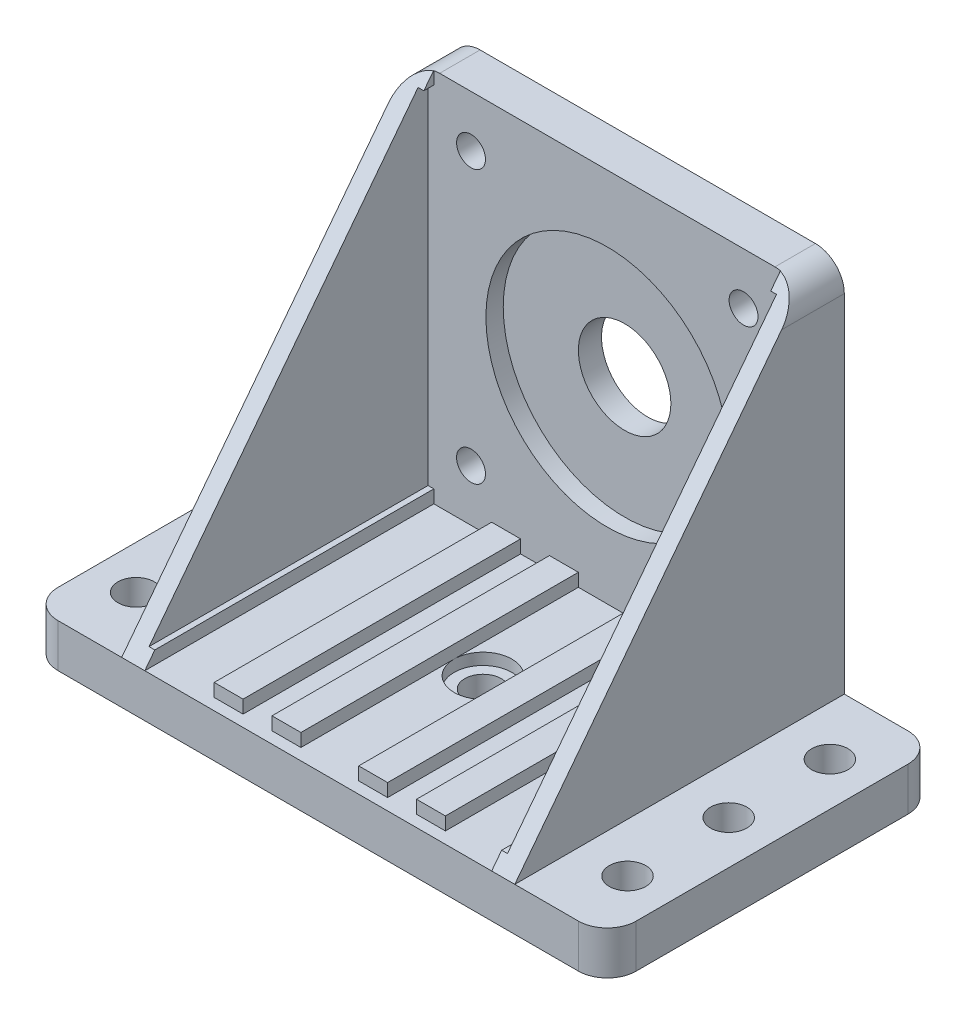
ISO-10303-21;
HEADER;
FILE_DESCRIPTION(('STEP AP214'),'2;1');
FILE_NAME('part.step','',(''),(''),'','','');
FILE_SCHEMA(('AUTOMOTIVE_DESIGN { 1 0 10303 214 1 1 1 1 }'));
ENDSEC;
DATA;
#1=APPLICATION_CONTEXT('core data for automotive mechanical design processes');
#2=APPLICATION_PROTOCOL_DEFINITION('international standard','automotive_design',2000,#1);
#3=PRODUCT_CONTEXT('',#1,'mechanical');
#4=PRODUCT('Part','Part','',(#3));
#5=PRODUCT_RELATED_PRODUCT_CATEGORY('part','',(#4));
#6=PRODUCT_DEFINITION_FORMATION('','',#4);
#7=PRODUCT_DEFINITION_CONTEXT('part definition',#1,'design');
#8=PRODUCT_DEFINITION('design','',#6,#7);
#9=PRODUCT_DEFINITION_SHAPE('','',#8);
#10=(LENGTH_UNIT() NAMED_UNIT(*) SI_UNIT(.MILLI.,.METRE.));
#11=(NAMED_UNIT(*) PLANE_ANGLE_UNIT() SI_UNIT($,.RADIAN.));
#12=(NAMED_UNIT(*) SI_UNIT($,.STERADIAN.) SOLID_ANGLE_UNIT());
#13=UNCERTAINTY_MEASURE_WITH_UNIT(LENGTH_MEASURE(1.E-05),#10,'distance_accuracy_value','');
#14=(GEOMETRIC_REPRESENTATION_CONTEXT(3) GLOBAL_UNCERTAINTY_ASSIGNED_CONTEXT((#13)) GLOBAL_UNIT_ASSIGNED_CONTEXT((#10,
#11,#12)) REPRESENTATION_CONTEXT('',''));
#15=CARTESIAN_POINT('',(0.,0.,0.));
#16=DIRECTION('',(0.,0.,1.));
#17=DIRECTION('',(1.,0.,0.));
#18=AXIS2_PLACEMENT_3D('',#15,#16,#17);
#19=CARTESIAN_POINT('',(10.,-60.72,7.));
#20=DIRECTION('',(1.,0.,0.));
#21=DIRECTION('',(0.,0.,-1.));
#22=AXIS2_PLACEMENT_3D('',#19,#20,#21);
#23=PLANE('',#22);
#24=DIRECTION('',(0.,0.,1.));
#25=VECTOR('',#24,1.);
#26=CARTESIAN_POINT('',(10.,-62.75,7.));
#27=LINE('',#26,#25);
#28=CARTESIAN_POINT('',(10.,-62.75,7.));
#29=VERTEX_POINT('',#28);
#30=CARTESIAN_POINT('',(10.,-62.75,55.));
#31=VERTEX_POINT('',#30);
#32=EDGE_CURVE('E367',#29,#31,#27,.T.);
#33=ORIENTED_EDGE('',*,*,#32,.F.);
#34=DIRECTION('',(0.,-1.,0.));
#35=VECTOR('',#34,1.);
#36=CARTESIAN_POINT('',(10.,-60.72,7.));
#37=LINE('',#36,#35);
#38=CARTESIAN_POINT('',(10.,-65.,7.));
#39=VERTEX_POINT('',#38);
#40=EDGE_CURVE('E540',#29,#39,#37,.T.);
#41=ORIENTED_EDGE('',*,*,#40,.T.);
#42=DIRECTION('',(0.,0.,1.));
#43=VECTOR('',#42,1.);
#44=CARTESIAN_POINT('',(10.,-65.,7.));
#45=LINE('',#44,#43);
#46=CARTESIAN_POINT('',(10.,-65.,55.));
#47=VERTEX_POINT('',#46);
#48=EDGE_CURVE('E531',#39,#47,#45,.T.);
#49=ORIENTED_EDGE('',*,*,#48,.T.);
#50=DIRECTION('',(0.,-1.,0.));
#51=VECTOR('',#50,1.);
#52=CARTESIAN_POINT('',(10.,-60.72,55.));
#53=LINE('',#52,#51);
#54=EDGE_CURVE('E546',#31,#47,#53,.T.);
#55=ORIENTED_EDGE('',*,*,#54,.F.);
#56=EDGE_LOOP('',(#33,#41,#49,#55));
#57=FACE_BOUND('',#56,.T.);
#58=ADVANCED_FACE('F32',(#57),#23,.F.);
#59=CARTESIAN_POINT('',(10.,-60.72,55.));
#60=DIRECTION('',(0.,0.,-1.));
#61=DIRECTION('',(-1.,0.,0.));
#62=AXIS2_PLACEMENT_3D('',#59,#60,#61);
#63=PLANE('',#62);
#64=DIRECTION('',(1.,0.,0.));
#65=VECTOR('',#64,1.);
#66=CARTESIAN_POINT('',(10.,-62.75,55.));
#67=LINE('',#66,#65);
#68=CARTESIAN_POINT('',(15.,-62.75,55.));
#69=VERTEX_POINT('',#68);
#70=EDGE_CURVE('E365',#31,#69,#67,.T.);
#71=ORIENTED_EDGE('',*,*,#70,.F.);
#72=ORIENTED_EDGE('',*,*,#54,.T.);
#73=DIRECTION('',(1.,0.,0.));
#74=VECTOR('',#73,1.);
#75=CARTESIAN_POINT('',(10.,-65.,55.));
#76=LINE('',#75,#74);
#77=CARTESIAN_POINT('',(15.,-65.,55.));
#78=VERTEX_POINT('',#77);
#79=EDGE_CURVE('E534',#47,#78,#76,.T.);
#80=ORIENTED_EDGE('',*,*,#79,.T.);
#81=DIRECTION('',(0.,-1.,0.));
#82=VECTOR('',#81,1.);
#83=CARTESIAN_POINT('',(15.,-60.72,55.));
#84=LINE('',#83,#82);
#85=EDGE_CURVE('E544',#69,#78,#84,.T.);
#86=ORIENTED_EDGE('',*,*,#85,.F.);
#87=EDGE_LOOP('',(#71,#72,#80,#86));
#88=FACE_BOUND('',#87,.T.);
#89=ADVANCED_FACE('F856',(#88),#63,.F.);
#90=CARTESIAN_POINT('',(15.,-60.72,7.));
#91=DIRECTION('',(-1.,0.,0.));
#92=DIRECTION('',(0.,0.,1.));
#93=AXIS2_PLACEMENT_3D('',#90,#91,#92);
#94=PLANE('',#93);
#95=DIRECTION('',(0.,0.,-1.));
#96=VECTOR('',#95,1.);
#97=CARTESIAN_POINT('',(15.,-62.75,7.));
#98=LINE('',#97,#96);
#99=CARTESIAN_POINT('',(15.,-62.75,7.));
#100=VERTEX_POINT('',#99);
#101=EDGE_CURVE('E363',#69,#100,#98,.T.);
#102=ORIENTED_EDGE('',*,*,#101,.F.);
#103=ORIENTED_EDGE('',*,*,#85,.T.);
#104=DIRECTION('',(0.,0.,-1.));
#105=VECTOR('',#104,1.);
#106=CARTESIAN_POINT('',(15.,-65.,7.));
#107=LINE('',#106,#105);
#108=CARTESIAN_POINT('',(15.,-65.,7.));
#109=VERTEX_POINT('',#108);
#110=EDGE_CURVE('E537',#78,#109,#107,.T.);
#111=ORIENTED_EDGE('',*,*,#110,.T.);
#112=DIRECTION('',(0.,-1.,0.));
#113=VECTOR('',#112,1.);
#114=CARTESIAN_POINT('',(15.,-60.72,7.));
#115=LINE('',#114,#113);
#116=EDGE_CURVE('E542',#100,#109,#115,.T.);
#117=ORIENTED_EDGE('',*,*,#116,.F.);
#118=EDGE_LOOP('',(#102,#103,#111,#117));
#119=FACE_BOUND('',#118,.T.);
#120=ADVANCED_FACE('F862',(#119),#94,.F.);
#121=CARTESIAN_POINT('',(45.,-60.72,7.));
#122=DIRECTION('',(1.,0.,0.));
#123=DIRECTION('',(0.,0.,-1.));
#124=AXIS2_PLACEMENT_3D('',#121,#122,#123);
#125=PLANE('',#124);
#126=DIRECTION('',(0.,0.,1.));
#127=VECTOR('',#126,1.);
#128=CARTESIAN_POINT('',(45.,-62.75,7.));
#129=LINE('',#128,#127);
#130=CARTESIAN_POINT('',(45.,-62.75,7.));
#131=VERTEX_POINT('',#130);
#132=CARTESIAN_POINT('',(45.,-62.75,55.));
#133=VERTEX_POINT('',#132);
#134=EDGE_CURVE('E361',#131,#133,#129,.T.);
#135=ORIENTED_EDGE('',*,*,#134,.F.);
#136=DIRECTION('',(0.,-1.,0.));
#137=VECTOR('',#136,1.);
#138=CARTESIAN_POINT('',(45.,-60.72,7.));
#139=LINE('',#138,#137);
#140=CARTESIAN_POINT('',(45.,-65.,7.));
#141=VERTEX_POINT('',#140);
#142=EDGE_CURVE('E523',#131,#141,#139,.T.);
#143=ORIENTED_EDGE('',*,*,#142,.T.);
#144=DIRECTION('',(0.,0.,1.));
#145=VECTOR('',#144,1.);
#146=CARTESIAN_POINT('',(45.,-65.,7.));
#147=LINE('',#146,#145);
#148=CARTESIAN_POINT('',(45.,-65.,55.));
#149=VERTEX_POINT('',#148);
#150=EDGE_CURVE('E514',#141,#149,#147,.T.);
#151=ORIENTED_EDGE('',*,*,#150,.T.);
#152=DIRECTION('',(0.,-1.,0.));
#153=VECTOR('',#152,1.);
#154=CARTESIAN_POINT('',(45.,-60.72,55.));
#155=LINE('',#154,#153);
#156=EDGE_CURVE('E529',#133,#149,#155,.T.);
#157=ORIENTED_EDGE('',*,*,#156,.F.);
#158=EDGE_LOOP('',(#135,#143,#151,#157));
#159=FACE_BOUND('',#158,.T.);
#160=ADVANCED_FACE('F822',(#159),#125,.F.);
#161=CARTESIAN_POINT('',(45.,-60.72,55.));
#162=DIRECTION('',(0.,0.,-1.));
#163=DIRECTION('',(-1.,0.,0.));
#164=AXIS2_PLACEMENT_3D('',#161,#162,#163);
#165=PLANE('',#164);
#166=DIRECTION('',(1.,0.,0.));
#167=VECTOR('',#166,1.);
#168=CARTESIAN_POINT('',(45.,-62.75,55.));
#169=LINE('',#168,#167);
#170=CARTESIAN_POINT('',(50.,-62.75,55.));
#171=VERTEX_POINT('',#170);
#172=EDGE_CURVE('E359',#133,#171,#169,.T.);
#173=ORIENTED_EDGE('',*,*,#172,.F.);
#174=ORIENTED_EDGE('',*,*,#156,.T.);
#175=DIRECTION('',(1.,0.,0.));
#176=VECTOR('',#175,1.);
#177=CARTESIAN_POINT('',(45.,-65.,55.));
#178=LINE('',#177,#176);
#179=CARTESIAN_POINT('',(50.,-65.,55.));
#180=VERTEX_POINT('',#179);
#181=EDGE_CURVE('E517',#149,#180,#178,.T.);
#182=ORIENTED_EDGE('',*,*,#181,.T.);
#183=DIRECTION('',(0.,-1.,0.));
#184=VECTOR('',#183,1.);
#185=CARTESIAN_POINT('',(50.,-60.72,55.));
#186=LINE('',#185,#184);
#187=EDGE_CURVE('E527',#171,#180,#186,.T.);
#188=ORIENTED_EDGE('',*,*,#187,.F.);
#189=EDGE_LOOP('',(#173,#174,#182,#188));
#190=FACE_BOUND('',#189,.T.);
#191=ADVANCED_FACE('F819',(#190),#165,.F.);
#192=CARTESIAN_POINT('',(50.,-60.72,7.));
#193=DIRECTION('',(-1.,0.,0.));
#194=DIRECTION('',(0.,0.,1.));
#195=AXIS2_PLACEMENT_3D('',#192,#193,#194);
#196=PLANE('',#195);
#197=DIRECTION('',(0.,0.,-1.));
#198=VECTOR('',#197,1.);
#199=CARTESIAN_POINT('',(50.,-62.75,7.));
#200=LINE('',#199,#198);
#201=CARTESIAN_POINT('',(50.,-62.75,7.));
#202=VERTEX_POINT('',#201);
#203=EDGE_CURVE('E357',#171,#202,#200,.T.);
#204=ORIENTED_EDGE('',*,*,#203,.F.);
#205=ORIENTED_EDGE('',*,*,#187,.T.);
#206=DIRECTION('',(0.,0.,-1.));
#207=VECTOR('',#206,1.);
#208=CARTESIAN_POINT('',(50.,-65.,7.));
#209=LINE('',#208,#207);
#210=CARTESIAN_POINT('',(50.,-65.,7.));
#211=VERTEX_POINT('',#210);
#212=EDGE_CURVE('E520',#180,#211,#209,.T.);
#213=ORIENTED_EDGE('',*,*,#212,.T.);
#214=DIRECTION('',(0.,-1.,0.));
#215=VECTOR('',#214,1.);
#216=CARTESIAN_POINT('',(50.,-60.72,7.));
#217=LINE('',#216,#215);
#218=EDGE_CURVE('E525',#202,#211,#217,.T.);
#219=ORIENTED_EDGE('',*,*,#218,.F.);
#220=EDGE_LOOP('',(#204,#205,#213,#219));
#221=FACE_BOUND('',#220,.T.);
#222=ADVANCED_FACE('F813',(#221),#196,.F.);
#223=CARTESIAN_POINT('',(35.,-60.72,7.));
#224=DIRECTION('',(1.,0.,0.));
#225=DIRECTION('',(0.,0.,-1.));
#226=AXIS2_PLACEMENT_3D('',#223,#224,#225);
#227=PLANE('',#226);
#228=DIRECTION('',(0.,0.,1.));
#229=VECTOR('',#228,1.);
#230=CARTESIAN_POINT('',(35.,-62.75,7.));
#231=LINE('',#230,#229);
#232=CARTESIAN_POINT('',(35.,-62.75,7.));
#233=VERTEX_POINT('',#232);
#234=CARTESIAN_POINT('',(35.,-62.75,55.));
#235=VERTEX_POINT('',#234);
#236=EDGE_CURVE('E355',#233,#235,#231,.T.);
#237=ORIENTED_EDGE('',*,*,#236,.F.);
#238=DIRECTION('',(0.,-1.,0.));
#239=VECTOR('',#238,1.);
#240=CARTESIAN_POINT('',(35.,-60.72,7.));
#241=LINE('',#240,#239);
#242=CARTESIAN_POINT('',(35.,-65.,7.));
#243=VERTEX_POINT('',#242);
#244=EDGE_CURVE('E506',#233,#243,#241,.T.);
#245=ORIENTED_EDGE('',*,*,#244,.T.);
#246=DIRECTION('',(0.,0.,1.));
#247=VECTOR('',#246,1.);
#248=CARTESIAN_POINT('',(35.,-65.,7.));
#249=LINE('',#248,#247);
#250=CARTESIAN_POINT('',(35.,-65.,28.5));
#251=VERTEX_POINT('',#250);
#252=EDGE_CURVE('E497',#243,#251,#249,.T.);
#253=ORIENTED_EDGE('',*,*,#252,.T.);
#254=CARTESIAN_POINT('',(35.,-65.,55.));
#255=VERTEX_POINT('',#254);
#256=EDGE_CURVE('E496',#251,#255,#249,.T.);
#257=ORIENTED_EDGE('',*,*,#256,.T.);
#258=DIRECTION('',(0.,-1.,0.));
#259=VECTOR('',#258,1.);
#260=CARTESIAN_POINT('',(35.,-60.72,55.));
#261=LINE('',#260,#259);
#262=EDGE_CURVE('E512',#235,#255,#261,.T.);
#263=ORIENTED_EDGE('',*,*,#262,.F.);
#264=EDGE_LOOP('',(#237,#245,#253,#257,#263));
#265=FACE_BOUND('',#264,.T.);
#266=ADVANCED_FACE('F790',(#265),#227,.F.);
#267=CARTESIAN_POINT('',(35.,-60.72,55.));
#268=DIRECTION('',(0.,0.,-1.));
#269=DIRECTION('',(-1.,0.,0.));
#270=AXIS2_PLACEMENT_3D('',#267,#268,#269);
#271=PLANE('',#270);
#272=DIRECTION('',(1.,0.,0.));
#273=VECTOR('',#272,1.);
#274=CARTESIAN_POINT('',(35.,-62.75,55.));
#275=LINE('',#274,#273);
#276=CARTESIAN_POINT('',(40.,-62.75,55.));
#277=VERTEX_POINT('',#276);
#278=EDGE_CURVE('E353',#235,#277,#275,.T.);
#279=ORIENTED_EDGE('',*,*,#278,.F.);
#280=ORIENTED_EDGE('',*,*,#262,.T.);
#281=DIRECTION('',(1.,0.,0.));
#282=VECTOR('',#281,1.);
#283=CARTESIAN_POINT('',(35.,-65.,55.));
#284=LINE('',#283,#282);
#285=CARTESIAN_POINT('',(40.,-65.,55.));
#286=VERTEX_POINT('',#285);
#287=EDGE_CURVE('E500',#255,#286,#284,.T.);
#288=ORIENTED_EDGE('',*,*,#287,.T.);
#289=DIRECTION('',(0.,-1.,0.));
#290=VECTOR('',#289,1.);
#291=CARTESIAN_POINT('',(40.,-60.72,55.));
#292=LINE('',#291,#290);
#293=EDGE_CURVE('E510',#277,#286,#292,.T.);
#294=ORIENTED_EDGE('',*,*,#293,.F.);
#295=EDGE_LOOP('',(#279,#280,#288,#294));
#296=FACE_BOUND('',#295,.T.);
#297=ADVANCED_FACE('F800',(#296),#271,.F.);
#298=CARTESIAN_POINT('',(40.,-60.72,7.));
#299=DIRECTION('',(-1.,0.,0.));
#300=DIRECTION('',(0.,0.,1.));
#301=AXIS2_PLACEMENT_3D('',#298,#299,#300);
#302=PLANE('',#301);
#303=DIRECTION('',(0.,0.,-1.));
#304=VECTOR('',#303,1.);
#305=CARTESIAN_POINT('',(40.,-62.75,7.));
#306=LINE('',#305,#304);
#307=CARTESIAN_POINT('',(40.,-62.75,7.));
#308=VERTEX_POINT('',#307);
#309=EDGE_CURVE('E351',#277,#308,#306,.T.);
#310=ORIENTED_EDGE('',*,*,#309,.F.);
#311=ORIENTED_EDGE('',*,*,#293,.T.);
#312=DIRECTION('',(0.,0.,-1.));
#313=VECTOR('',#312,1.);
#314=CARTESIAN_POINT('',(40.,-65.,7.));
#315=LINE('',#314,#313);
#316=CARTESIAN_POINT('',(40.,-65.,7.));
#317=VERTEX_POINT('',#316);
#318=EDGE_CURVE('E503',#286,#317,#315,.T.);
#319=ORIENTED_EDGE('',*,*,#318,.T.);
#320=DIRECTION('',(0.,-1.,0.));
#321=VECTOR('',#320,1.);
#322=CARTESIAN_POINT('',(40.,-60.72,7.));
#323=LINE('',#322,#321);
#324=EDGE_CURVE('E508',#308,#317,#323,.T.);
#325=ORIENTED_EDGE('',*,*,#324,.F.);
#326=EDGE_LOOP('',(#310,#311,#319,#325));
#327=FACE_BOUND('',#326,.T.);
#328=ADVANCED_FACE('F803',(#327),#302,.F.);
#329=CARTESIAN_POINT('',(20.,-60.72,7.));
#330=DIRECTION('',(1.,0.,0.));
#331=DIRECTION('',(0.,0.,-1.));
#332=AXIS2_PLACEMENT_3D('',#329,#330,#331);
#333=PLANE('',#332);
#334=DIRECTION('',(0.,0.,1.));
#335=VECTOR('',#334,1.);
#336=CARTESIAN_POINT('',(20.,-62.75,7.));
#337=LINE('',#336,#335);
#338=CARTESIAN_POINT('',(20.,-62.75,7.));
#339=VERTEX_POINT('',#338);
#340=CARTESIAN_POINT('',(20.,-62.75,55.));
#341=VERTEX_POINT('',#340);
#342=EDGE_CURVE('E349',#339,#341,#337,.T.);
#343=ORIENTED_EDGE('',*,*,#342,.F.);
#344=DIRECTION('',(0.,-1.,0.));
#345=VECTOR('',#344,1.);
#346=CARTESIAN_POINT('',(20.,-60.72,7.));
#347=LINE('',#346,#345);
#348=CARTESIAN_POINT('',(20.,-65.,7.));
#349=VERTEX_POINT('',#348);
#350=EDGE_CURVE('E488',#339,#349,#347,.T.);
#351=ORIENTED_EDGE('',*,*,#350,.T.);
#352=DIRECTION('',(0.,0.,1.));
#353=VECTOR('',#352,1.);
#354=CARTESIAN_POINT('',(20.,-65.,7.));
#355=LINE('',#354,#353);
#356=CARTESIAN_POINT('',(20.,-65.,55.));
#357=VERTEX_POINT('',#356);
#358=EDGE_CURVE('E478',#349,#357,#355,.T.);
#359=ORIENTED_EDGE('',*,*,#358,.T.);
#360=DIRECTION('',(0.,-1.,0.));
#361=VECTOR('',#360,1.);
#362=CARTESIAN_POINT('',(20.,-60.72,55.));
#363=LINE('',#362,#361);
#364=EDGE_CURVE('E494',#341,#357,#363,.T.);
#365=ORIENTED_EDGE('',*,*,#364,.F.);
#366=EDGE_LOOP('',(#343,#351,#359,#365));
#367=FACE_BOUND('',#366,.T.);
#368=ADVANCED_FACE('F839',(#367),#333,.F.);
#369=CARTESIAN_POINT('',(20.,-60.72,55.));
#370=DIRECTION('',(0.,0.,-1.));
#371=DIRECTION('',(-1.,0.,0.));
#372=AXIS2_PLACEMENT_3D('',#369,#370,#371);
#373=PLANE('',#372);
#374=DIRECTION('',(1.,0.,0.));
#375=VECTOR('',#374,1.);
#376=CARTESIAN_POINT('',(20.,-62.75,55.));
#377=LINE('',#376,#375);
#378=CARTESIAN_POINT('',(25.,-62.75,55.));
#379=VERTEX_POINT('',#378);
#380=EDGE_CURVE('E347',#341,#379,#377,.T.);
#381=ORIENTED_EDGE('',*,*,#380,.F.);
#382=ORIENTED_EDGE('',*,*,#364,.T.);
#383=DIRECTION('',(1.,0.,0.));
#384=VECTOR('',#383,1.);
#385=CARTESIAN_POINT('',(20.,-65.,55.));
#386=LINE('',#385,#384);
#387=CARTESIAN_POINT('',(25.,-65.,55.));
#388=VERTEX_POINT('',#387);
#389=EDGE_CURVE('E481',#357,#388,#386,.T.);
#390=ORIENTED_EDGE('',*,*,#389,.T.);
#391=DIRECTION('',(0.,-1.,0.));
#392=VECTOR('',#391,1.);
#393=CARTESIAN_POINT('',(25.,-60.72,55.));
#394=LINE('',#393,#392);
#395=EDGE_CURVE('E492',#379,#388,#394,.T.);
#396=ORIENTED_EDGE('',*,*,#395,.F.);
#397=EDGE_LOOP('',(#381,#382,#390,#396));
#398=FACE_BOUND('',#397,.T.);
#399=ADVANCED_FACE('F833',(#398),#373,.F.);
#400=CARTESIAN_POINT('',(25.,-60.72,7.));
#401=DIRECTION('',(-1.,0.,0.));
#402=DIRECTION('',(0.,0.,1.));
#403=AXIS2_PLACEMENT_3D('',#400,#401,#402);
#404=PLANE('',#403);
#405=DIRECTION('',(0.,0.,-1.));
#406=VECTOR('',#405,1.);
#407=CARTESIAN_POINT('',(25.,-62.75,7.));
#408=LINE('',#407,#406);
#409=CARTESIAN_POINT('',(25.,-62.75,7.));
#410=VERTEX_POINT('',#409);
#411=EDGE_CURVE('E345',#379,#410,#408,.T.);
#412=ORIENTED_EDGE('',*,*,#411,.F.);
#413=ORIENTED_EDGE('',*,*,#395,.T.);
#414=DIRECTION('',(0.,0.,-1.));
#415=VECTOR('',#414,1.);
#416=CARTESIAN_POINT('',(25.,-65.,7.));
#417=LINE('',#416,#415);
#418=CARTESIAN_POINT('',(25.,-65.,28.5));
#419=VERTEX_POINT('',#418);
#420=EDGE_CURVE('E485',#388,#419,#417,.T.);
#421=ORIENTED_EDGE('',*,*,#420,.T.);
#422=CARTESIAN_POINT('',(25.,-65.,7.));
#423=VERTEX_POINT('',#422);
#424=EDGE_CURVE('E484',#419,#423,#417,.T.);
#425=ORIENTED_EDGE('',*,*,#424,.T.);
#426=DIRECTION('',(0.,-1.,0.));
#427=VECTOR('',#426,1.);
#428=CARTESIAN_POINT('',(25.,-60.72,7.));
#429=LINE('',#428,#427);
#430=EDGE_CURVE('E490',#410,#423,#429,.T.);
#431=ORIENTED_EDGE('',*,*,#430,.F.);
#432=EDGE_LOOP('',(#412,#413,#421,#425,#431));
#433=FACE_BOUND('',#432,.T.);
#434=ADVANCED_FACE('F829',(#433),#404,.F.);
#435=CARTESIAN_POINT('',(64.,0.,7.));
#436=DIRECTION('',(0.,-0.609710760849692,-0.7926239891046));
#437=DIRECTION('',(0.,0.7926239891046,-0.609710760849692));
#438=AXIS2_PLACEMENT_3D('',#435,#436,#437);
#439=PLANE('',#438);
#440=DIRECTION('',(-1.,0.,0.));
#441=VECTOR('',#440,1.);
#442=CARTESIAN_POINT('',(64.,-2.25,8.73076923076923));
#443=LINE('',#442,#441);
#444=CARTESIAN_POINT('',(61.,-2.25,8.73076923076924));
#445=VERTEX_POINT('',#444);
#446=CARTESIAN_POINT('',(60.,-2.25,8.73076923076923));
#447=VERTEX_POINT('',#446);
#448=EDGE_CURVE('E372',#445,#447,#443,.T.);
#449=ORIENTED_EDGE('',*,*,#448,.F.);
#450=DIRECTION('',(0.,0.7926239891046,-0.609710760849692));
#451=VECTOR('',#450,1.);
#452=CARTESIAN_POINT('',(61.,0.,7.));
#453=LINE('',#452,#451);
#454=CARTESIAN_POINT('',(61.,-62.75,55.2692307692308));
#455=VERTEX_POINT('',#454);
#456=EDGE_CURVE('E11',#455,#445,#453,.T.);
#457=ORIENTED_EDGE('',*,*,#456,.F.);
#458=DIRECTION('',(1.,0.,0.));
#459=VECTOR('',#458,1.);
#460=CARTESIAN_POINT('',(64.,-62.75,55.2692307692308));
#461=LINE('',#460,#459);
#462=CARTESIAN_POINT('',(60.,-62.75,55.2692307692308));
#463=VERTEX_POINT('',#462);
#464=EDGE_CURVE('E343',#463,#455,#461,.T.);
#465=ORIENTED_EDGE('',*,*,#464,.F.);
#466=DIRECTION('',(0.,-0.7926239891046,0.609710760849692));
#467=VECTOR('',#466,1.);
#468=CARTESIAN_POINT('',(60.,0.,7.));
#469=LINE('',#468,#467);
#470=CARTESIAN_POINT('',(60.,-65.,57.));
#471=VERTEX_POINT('',#470);
#472=EDGE_CURVE('E404',#463,#471,#469,.T.);
#473=ORIENTED_EDGE('',*,*,#472,.T.);
#474=DIRECTION('',(-1.,0.,0.));
#475=VECTOR('',#474,1.);
#476=CARTESIAN_POINT('',(64.,-65.,57.));
#477=LINE('',#476,#475);
#478=CARTESIAN_POINT('',(64.,-65.,57.));
#479=VERTEX_POINT('',#478);
#480=EDGE_CURVE('E401',#479,#471,#477,.T.);
#481=ORIENTED_EDGE('',*,*,#480,.F.);
#482=DIRECTION('',(0.,-0.7926239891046,0.609710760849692));
#483=VECTOR('',#482,1.);
#484=CARTESIAN_POINT('',(64.,0.,7.));
#485=LINE('',#484,#483);
#486=CARTESIAN_POINT('',(64.,-5.,10.8461538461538));
#487=VERTEX_POINT('',#486);
#488=EDGE_CURVE('E399',#487,#479,#485,.T.);
#489=ORIENTED_EDGE('',*,*,#488,.F.);
#490=CARTESIAN_POINT('',(59.,-5.,10.8461538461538));
#491=DIRECTION('',(0.,-0.609710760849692,-0.7926239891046));
#492=DIRECTION('',(0.,0.7926239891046,-0.609710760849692));
#493=AXIS2_PLACEMENT_3D('',#490,#491,#492);
#494=ELLIPSE('',#493,6.30816133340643,5.);
#495=CARTESIAN_POINT('',(60.,-0.101020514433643,7.07770808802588));
#496=VERTEX_POINT('',#495);
#497=EDGE_CURVE('E652',#487,#496,#494,.F.);
#498=ORIENTED_EDGE('',*,*,#497,.T.);
#499=EDGE_CURVE('E396',#496,#447,#469,.T.);
#500=ORIENTED_EDGE('',*,*,#499,.T.);
#501=EDGE_LOOP('',(#449,#457,#465,#473,#481,#489,#498,#500));
#502=FACE_BOUND('',#501,.T.);
#503=ADVANCED_FACE('F756',(#502),#439,.F.);
#504=CARTESIAN_POINT('',(60.,0.,0.));
#505=DIRECTION('',(1.,0.,0.));
#506=DIRECTION('',(0.,1.,0.));
#507=AXIS2_PLACEMENT_3D('',#504,#505,#506);
#508=PLANE('',#507);
#509=DIRECTION('',(0.,0.,-1.));
#510=VECTOR('',#509,1.);
#511=CARTESIAN_POINT('',(60.,-2.25,0.));
#512=LINE('',#511,#510);
#513=CARTESIAN_POINT('',(60.,-2.25,7.));
#514=VERTEX_POINT('',#513);
#515=EDGE_CURVE('E319',#447,#514,#512,.T.);
#516=ORIENTED_EDGE('',*,*,#515,.F.);
#517=ORIENTED_EDGE('',*,*,#499,.F.);
#518=DIRECTION('',(0.,0.,-1.));
#519=VECTOR('',#518,1.);
#520=CARTESIAN_POINT('',(60.,-0.101020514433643,7.07770808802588));
#521=LINE('',#520,#519);
#522=CARTESIAN_POINT('',(60.,-0.101020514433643,7.));
#523=VERTEX_POINT('',#522);
#524=EDGE_CURVE('E654',#496,#523,#521,.T.);
#525=ORIENTED_EDGE('',*,*,#524,.T.);
#526=DIRECTION('',(0.,1.,0.));
#527=VECTOR('',#526,1.);
#528=CARTESIAN_POINT('',(60.,0.,7.));
#529=LINE('',#528,#527);
#530=EDGE_CURVE('E595',#514,#523,#529,.T.);
#531=ORIENTED_EDGE('',*,*,#530,.F.);
#532=EDGE_LOOP('',(#516,#517,#525,#531));
#533=FACE_BOUND('',#532,.T.);
#534=ADVANCED_FACE('F1055',(#533),#508,.F.);
#535=DIRECTION('',(0.,0.,1.));
#536=VECTOR('',#535,1.);
#537=CARTESIAN_POINT('',(60.,-62.75,0.));
#538=LINE('',#537,#536);
#539=CARTESIAN_POINT('',(60.,-62.75,7.));
#540=VERTEX_POINT('',#539);
#541=EDGE_CURVE('E341',#540,#463,#538,.T.);
#542=ORIENTED_EDGE('',*,*,#541,.F.);
#543=CARTESIAN_POINT('',(60.,-65.,7.));
#544=VERTEX_POINT('',#543);
#545=EDGE_CURVE('E598',#544,#540,#529,.T.);
#546=ORIENTED_EDGE('',*,*,#545,.F.);
#547=DIRECTION('',(0.,0.,-1.));
#548=VECTOR('',#547,1.);
#549=CARTESIAN_POINT('',(60.,-65.,57.));
#550=LINE('',#549,#548);
#551=EDGE_CURVE('E391',#471,#544,#550,.T.);
#552=ORIENTED_EDGE('',*,*,#551,.F.);
#553=ORIENTED_EDGE('',*,*,#472,.F.);
#554=EDGE_LOOP('',(#542,#546,#552,#553));
#555=FACE_BOUND('',#554,.T.);
#556=ADVANCED_FACE('F763',(#555),#508,.F.);
#557=CARTESIAN_POINT('',(-4.,-65.,57.));
#558=DIRECTION('',(0.,-0.609710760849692,-0.7926239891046));
#559=DIRECTION('',(0.,0.7926239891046,-0.609710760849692));
#560=AXIS2_PLACEMENT_3D('',#557,#558,#559);
#561=PLANE('',#560);
#562=DIRECTION('',(-1.,0.,0.));
#563=VECTOR('',#562,1.);
#564=CARTESIAN_POINT('',(-4.,-2.25,8.73076923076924));
#565=LINE('',#564,#563);
#566=CARTESIAN_POINT('',(0.,-2.25,8.73076923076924));
#567=VERTEX_POINT('',#566);
#568=CARTESIAN_POINT('',(-1.,-2.24999999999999,8.73076923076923));
#569=VERTEX_POINT('',#568);
#570=EDGE_CURVE('E369',#567,#569,#565,.T.);
#571=ORIENTED_EDGE('',*,*,#570,.F.);
#572=DIRECTION('',(0.,0.7926239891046,-0.609710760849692));
#573=VECTOR('',#572,1.);
#574=CARTESIAN_POINT('',(0.,-65.,57.));
#575=LINE('',#574,#573);
#576=CARTESIAN_POINT('',(0.,-0.101020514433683,7.07770808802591));
#577=VERTEX_POINT('',#576);
#578=EDGE_CURVE('E387',#567,#577,#575,.T.);
#579=ORIENTED_EDGE('',*,*,#578,.T.);
#580=CARTESIAN_POINT('',(1.,-5.,10.8461538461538));
#581=DIRECTION('',(0.,-0.609710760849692,-0.7926239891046));
#582=DIRECTION('',(0.,-0.7926239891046,0.609710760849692));
#583=AXIS2_PLACEMENT_3D('',#580,#581,#582);
#584=ELLIPSE('',#583,6.30816133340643,5.);
#585=CARTESIAN_POINT('',(-4.,-5.,10.8461538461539));
#586=VERTEX_POINT('',#585);
#587=EDGE_CURVE('E671',#577,#586,#584,.F.);
#588=ORIENTED_EDGE('',*,*,#587,.T.);
#589=DIRECTION('',(0.,0.7926239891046,-0.609710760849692));
#590=VECTOR('',#589,1.);
#591=CARTESIAN_POINT('',(-4.,-65.,57.));
#592=LINE('',#591,#590);
#593=CARTESIAN_POINT('',(-4.,-65.,57.));
#594=VERTEX_POINT('',#593);
#595=EDGE_CURVE('E381',#594,#586,#592,.T.);
#596=ORIENTED_EDGE('',*,*,#595,.F.);
#597=DIRECTION('',(1.,0.,0.));
#598=VECTOR('',#597,1.);
#599=CARTESIAN_POINT('',(-4.,-65.,57.));
#600=LINE('',#599,#598);
#601=CARTESIAN_POINT('',(0.,-65.,57.));
#602=VERTEX_POINT('',#601);
#603=EDGE_CURVE('E384',#594,#602,#600,.T.);
#604=ORIENTED_EDGE('',*,*,#603,.T.);
#605=CARTESIAN_POINT('',(0.,-62.75,55.2692307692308));
#606=VERTEX_POINT('',#605);
#607=EDGE_CURVE('E378',#602,#606,#575,.T.);
#608=ORIENTED_EDGE('',*,*,#607,.T.);
#609=DIRECTION('',(1.,0.,0.));
#610=VECTOR('',#609,1.);
#611=CARTESIAN_POINT('',(-4.,-62.75,55.2692307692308));
#612=LINE('',#611,#610);
#613=CARTESIAN_POINT('',(-0.999999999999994,-62.75,55.2692307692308));
#614=VERTEX_POINT('',#613);
#615=EDGE_CURVE('E314',#614,#606,#612,.T.);
#616=ORIENTED_EDGE('',*,*,#615,.F.);
#617=DIRECTION('',(0.,-0.7926239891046,0.609710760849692));
#618=VECTOR('',#617,1.);
#619=CARTESIAN_POINT('',(-0.999999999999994,-65.,57.));
#620=LINE('',#619,#618);
#621=EDGE_CURVE('E40',#569,#614,#620,.T.);
#622=ORIENTED_EDGE('',*,*,#621,.F.);
#623=EDGE_LOOP('',(#571,#579,#588,#596,#604,#608,#616,#622));
#624=FACE_BOUND('',#623,.T.);
#625=ADVANCED_FACE('F688',(#624),#561,.F.);
#626=CARTESIAN_POINT('',(0.,0.,0.));
#627=DIRECTION('',(-1.,0.,0.));
#628=DIRECTION('',(0.,0.,1.));
#629=AXIS2_PLACEMENT_3D('',#626,#627,#628);
#630=PLANE('',#629);
#631=DIRECTION('',(0.,0.,1.));
#632=VECTOR('',#631,1.);
#633=CARTESIAN_POINT('',(0.,-2.25,0.));
#634=LINE('',#633,#632);
#635=CARTESIAN_POINT('',(0.,-2.25,7.));
#636=VERTEX_POINT('',#635);
#637=EDGE_CURVE('E675',#636,#567,#634,.T.);
#638=ORIENTED_EDGE('',*,*,#637,.F.);
#639=DIRECTION('',(0.,-1.,0.));
#640=VECTOR('',#639,1.);
#641=CARTESIAN_POINT('',(0.,0.,7.));
#642=LINE('',#641,#640);
#643=CARTESIAN_POINT('',(0.,-0.101020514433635,7.));
#644=VERTEX_POINT('',#643);
#645=EDGE_CURVE('E587',#644,#636,#642,.T.);
#646=ORIENTED_EDGE('',*,*,#645,.F.);
#647=DIRECTION('',(0.,0.,1.));
#648=VECTOR('',#647,1.);
#649=CARTESIAN_POINT('',(0.,-0.101020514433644,7.));
#650=LINE('',#649,#648);
#651=EDGE_CURVE('E668',#644,#577,#650,.T.);
#652=ORIENTED_EDGE('',*,*,#651,.T.);
#653=ORIENTED_EDGE('',*,*,#578,.F.);
#654=EDGE_LOOP('',(#638,#646,#652,#653));
#655=FACE_BOUND('',#654,.T.);
#656=ADVANCED_FACE('F934',(#655),#630,.F.);
#657=DIRECTION('',(0.,0.,-1.));
#658=VECTOR('',#657,1.);
#659=CARTESIAN_POINT('',(0.,-62.75,0.));
#660=LINE('',#659,#658);
#661=CARTESIAN_POINT('',(0.,-62.75,7.));
#662=VERTEX_POINT('',#661);
#663=EDGE_CURVE('E673',#606,#662,#660,.T.);
#664=ORIENTED_EDGE('',*,*,#663,.F.);
#665=ORIENTED_EDGE('',*,*,#607,.F.);
#666=DIRECTION('',(0.,0.,1.));
#667=VECTOR('',#666,1.);
#668=CARTESIAN_POINT('',(0.,-65.,0.));
#669=LINE('',#668,#667);
#670=CARTESIAN_POINT('',(0.,-65.,7.));
#671=VERTEX_POINT('',#670);
#672=EDGE_CURVE('E374',#671,#602,#669,.T.);
#673=ORIENTED_EDGE('',*,*,#672,.F.);
#674=EDGE_CURVE('E591',#662,#671,#642,.T.);
#675=ORIENTED_EDGE('',*,*,#674,.F.);
#676=EDGE_LOOP('',(#664,#665,#673,#675));
#677=FACE_BOUND('',#676,.T.);
#678=ADVANCED_FACE('F693',(#677),#630,.F.);
#679=CARTESIAN_POINT('',(0.,-65.,0.));
#680=DIRECTION('',(0.,1.,0.));
#681=DIRECTION('',(0.,0.,1.));
#682=AXIS2_PLACEMENT_3D('',#679,#680,#681);
#683=PLANE('',#682);
#684=DIRECTION('',(1.,0.,0.));
#685=VECTOR('',#684,1.);
#686=CARTESIAN_POINT('',(0.,-65.,7.));
#687=LINE('',#686,#685);
#688=EDGE_CURVE('E592',#671,#39,#687,.T.);
#689=ORIENTED_EDGE('',*,*,#688,.F.);
#690=ORIENTED_EDGE('',*,*,#672,.T.);
#691=DIRECTION('',(-1.,0.,0.));
#692=VECTOR('',#691,1.);
#693=CARTESIAN_POINT('',(0.,-65.,57.));
#694=LINE('',#693,#692);
#695=EDGE_CURVE('E553',#471,#602,#694,.T.);
#696=ORIENTED_EDGE('',*,*,#695,.F.);
#697=ORIENTED_EDGE('',*,*,#551,.T.);
#698=EDGE_CURVE('E590',#211,#544,#687,.T.);
#699=ORIENTED_EDGE('',*,*,#698,.F.);
#700=ORIENTED_EDGE('',*,*,#212,.F.);
#701=ORIENTED_EDGE('',*,*,#181,.F.);
#702=ORIENTED_EDGE('',*,*,#150,.F.);
#703=EDGE_CURVE('E769',#317,#141,#687,.T.);
#704=ORIENTED_EDGE('',*,*,#703,.F.);
#705=ORIENTED_EDGE('',*,*,#318,.F.);
#706=ORIENTED_EDGE('',*,*,#287,.F.);
#707=ORIENTED_EDGE('',*,*,#256,.F.);
#708=CARTESIAN_POINT('',(30.,-65.,28.5));
#709=DIRECTION('',(0.,1.,0.));
#710=DIRECTION('',(0.,0.,1.));
#711=AXIS2_PLACEMENT_3D('',#708,#709,#710);
#712=CIRCLE('',#711,5.);
#713=EDGE_CURVE('E409',#419,#251,#712,.T.);
#714=ORIENTED_EDGE('',*,*,#713,.F.);
#715=ORIENTED_EDGE('',*,*,#420,.F.);
#716=ORIENTED_EDGE('',*,*,#389,.F.);
#717=ORIENTED_EDGE('',*,*,#358,.F.);
#718=EDGE_CURVE('E596',#109,#349,#687,.T.);
#719=ORIENTED_EDGE('',*,*,#718,.F.);
#720=ORIENTED_EDGE('',*,*,#110,.F.);
#721=ORIENTED_EDGE('',*,*,#79,.F.);
#722=ORIENTED_EDGE('',*,*,#48,.F.);
#723=EDGE_LOOP('',(#689,#690,#696,#697,#699,#700,#701,#702,#704,#705,#706,#707,#714,#715,#716,
#717,#719,#720,#721,#722));
#724=FACE_BOUND('',#723,.T.);
#725=ADVANCED_FACE('F699',(#724),#683,.T.);
#726=DIRECTION('',(1.,0.,0.));
#727=VECTOR('',#726,1.);
#728=CARTESIAN_POINT('',(80.,-65.,0.));
#729=LINE('',#728,#727);
#730=CARTESIAN_POINT('',(-15.,-65.,0.));
#731=VERTEX_POINT('',#730);
#732=CARTESIAN_POINT('',(-4.,-65.,0.));
#733=VERTEX_POINT('',#732);
#734=EDGE_CURVE('E464',#731,#733,#729,.T.);
#735=ORIENTED_EDGE('',*,*,#734,.F.);
#736=CARTESIAN_POINT('',(-15.,-65.,5.));
#737=DIRECTION('',(0.,1.,0.));
#738=DIRECTION('',(0.,0.,1.));
#739=AXIS2_PLACEMENT_3D('',#736,#737,#738);
#740=CIRCLE('',#739,5.);
#741=CARTESIAN_POINT('',(-20.,-65.,5.));
#742=VERTEX_POINT('',#741);
#743=EDGE_CURVE('E633',#731,#742,#740,.T.);
#744=ORIENTED_EDGE('',*,*,#743,.T.);
#745=DIRECTION('',(0.,0.,-1.));
#746=VECTOR('',#745,1.);
#747=CARTESIAN_POINT('',(-20.,-65.,0.));
#748=LINE('',#747,#746);
#749=CARTESIAN_POINT('',(-20.,-65.,52.));
#750=VERTEX_POINT('',#749);
#751=EDGE_CURVE('E459',#750,#742,#748,.T.);
#752=ORIENTED_EDGE('',*,*,#751,.F.);
#753=CARTESIAN_POINT('',(-15.,-65.,52.));
#754=DIRECTION('',(0.,1.,0.));
#755=DIRECTION('',(0.,0.,1.));
#756=AXIS2_PLACEMENT_3D('',#753,#754,#755);
#757=CIRCLE('',#756,5.);
#758=CARTESIAN_POINT('',(-15.,-65.,57.));
#759=VERTEX_POINT('',#758);
#760=EDGE_CURVE('E631',#750,#759,#757,.T.);
#761=ORIENTED_EDGE('',*,*,#760,.T.);
#762=EDGE_CURVE('E548',#594,#759,#694,.T.);
#763=ORIENTED_EDGE('',*,*,#762,.F.);
#764=DIRECTION('',(0.,0.,1.));
#765=VECTOR('',#764,1.);
#766=CARTESIAN_POINT('',(-4.,-65.,0.));
#767=LINE('',#766,#765);
#768=EDGE_CURVE('E377',#733,#594,#767,.T.);
#769=ORIENTED_EDGE('',*,*,#768,.F.);
#770=EDGE_LOOP('',(#735,#744,#752,#761,#763,#769));
#771=FACE_BOUND('',#770,.T.);
#772=CARTESIAN_POINT('',(-12.5,-65.,28.5));
#773=DIRECTION('',(0.,1.,0.));
#774=DIRECTION('',(0.,0.,1.));
#775=AXIS2_PLACEMENT_3D('',#772,#773,#774);
#776=CIRCLE('',#775,3.15);
#777=CARTESIAN_POINT('',(-12.5,-65.,31.65));
#778=VERTEX_POINT('',#777);
#779=EDGE_CURVE('E441',#778,#778,#776,.T.);
#780=ORIENTED_EDGE('',*,*,#779,.F.);
#781=EDGE_LOOP('',(#780));
#782=FACE_BOUND('',#781,.T.);
#783=CARTESIAN_POINT('',(-12.5,-65.,46.));
#784=DIRECTION('',(0.,1.,0.));
#785=DIRECTION('',(0.,0.,1.));
#786=AXIS2_PLACEMENT_3D('',#783,#784,#785);
#787=CIRCLE('',#786,3.15);
#788=CARTESIAN_POINT('',(-12.5,-65.,49.15));
#789=VERTEX_POINT('',#788);
#790=EDGE_CURVE('E420',#789,#789,#787,.T.);
#791=ORIENTED_EDGE('',*,*,#790,.F.);
#792=EDGE_LOOP('',(#791));
#793=FACE_BOUND('',#792,.T.);
#794=CARTESIAN_POINT('',(-12.5,-65.,11.));
#795=DIRECTION('',(0.,1.,0.));
#796=DIRECTION('',(0.,0.,1.));
#797=AXIS2_PLACEMENT_3D('',#794,#795,#796);
#798=CIRCLE('',#797,3.15);
#799=CARTESIAN_POINT('',(-12.5,-65.,14.15));
#800=VERTEX_POINT('',#799);
#801=EDGE_CURVE('E429',#800,#800,#798,.T.);
#802=ORIENTED_EDGE('',*,*,#801,.F.);
#803=EDGE_LOOP('',(#802));
#804=FACE_BOUND('',#803,.T.);
#805=ADVANCED_FACE('F939',(#771,#782,#793,#804),#683,.T.);
#806=EDGE_CURVE('E414',#251,#419,#712,.T.);
#807=ORIENTED_EDGE('',*,*,#806,.F.);
#808=ORIENTED_EDGE('',*,*,#252,.F.);
#809=EDGE_CURVE('E597',#423,#243,#687,.T.);
#810=ORIENTED_EDGE('',*,*,#809,.F.);
#811=ORIENTED_EDGE('',*,*,#424,.F.);
#812=EDGE_LOOP('',(#807,#808,#810,#811));
#813=FACE_BOUND('',#812,.T.);
#814=ADVANCED_FACE('F785',(#813),#683,.T.);
#815=CARTESIAN_POINT('',(30.,-72.5,28.5));
#816=DIRECTION('',(0.,1.,0.));
#817=DIRECTION('',(0.,0.,1.));
#818=AXIS2_PLACEMENT_3D('',#815,#816,#817);
#819=CYLINDRICAL_SURFACE('',#818,3.15);
#820=CARTESIAN_POINT('',(30.,-72.5,28.5));
#821=DIRECTION('',(0.,1.,0.));
#822=DIRECTION('',(0.,0.,1.));
#823=AXIS2_PLACEMENT_3D('',#820,#821,#822);
#824=CIRCLE('',#823,3.15);
#825=CARTESIAN_POINT('',(30.,-72.5,31.65));
#826=VERTEX_POINT('',#825);
#827=EDGE_CURVE('E423',#826,#826,#824,.T.);
#828=ORIENTED_EDGE('',*,*,#827,.F.);
#829=EDGE_LOOP('',(#828));
#830=FACE_BOUND('',#829,.T.);
#831=CARTESIAN_POINT('',(30.,-67.,28.5));
#832=DIRECTION('',(0.,1.,0.));
#833=DIRECTION('',(0.,0.,1.));
#834=AXIS2_PLACEMENT_3D('',#831,#832,#833);
#835=CIRCLE('',#834,3.15);
#836=CARTESIAN_POINT('',(30.,-67.,31.65));
#837=VERTEX_POINT('',#836);
#838=EDGE_CURVE('E413',#837,#837,#835,.F.);
#839=ORIENTED_EDGE('',*,*,#838,.F.);
#840=EDGE_LOOP('',(#839));
#841=FACE_BOUND('',#840,.T.);
#842=ADVANCED_FACE('F896',(#830,#841),#819,.F.);
#843=CARTESIAN_POINT('',(30.,-32.5,0.));
#844=DIRECTION('',(0.,0.,1.));
#845=DIRECTION('',(1.,0.,0.));
#846=AXIS2_PLACEMENT_3D('',#843,#844,#845);
#847=CYLINDRICAL_SURFACE('',#846,8.);
#848=CARTESIAN_POINT('',(30.,-32.5,0.));
#849=DIRECTION('',(0.,0.,1.));
#850=DIRECTION('',(1.,0.,0.));
#851=AXIS2_PLACEMENT_3D('',#848,#849,#850);
#852=CIRCLE('',#851,8.);
#853=CARTESIAN_POINT('',(38.,-32.5,0.));
#854=VERTEX_POINT('',#853);
#855=EDGE_CURVE('E563',#854,#854,#852,.T.);
#856=ORIENTED_EDGE('',*,*,#855,.F.);
#857=EDGE_LOOP('',(#856));
#858=FACE_BOUND('',#857,.T.);
#859=CARTESIAN_POINT('',(30.,-32.5,4.));
#860=DIRECTION('',(0.,0.,1.));
#861=DIRECTION('',(1.,0.,0.));
#862=AXIS2_PLACEMENT_3D('',#859,#860,#861);
#863=CIRCLE('',#862,8.);
#864=CARTESIAN_POINT('',(38.,-32.5,4.));
#865=VERTEX_POINT('',#864);
#866=EDGE_CURVE('E475',#865,#865,#863,.F.);
#867=ORIENTED_EDGE('',*,*,#866,.F.);
#868=EDGE_LOOP('',(#867));
#869=FACE_BOUND('',#868,.T.);
#870=ADVANCED_FACE('F893',(#858,#869),#847,.F.);
#871=CARTESIAN_POINT('',(0.,0.,7.));
#872=DIRECTION('',(0.,0.,1.));
#873=DIRECTION('',(1.,0.,0.));
#874=AXIS2_PLACEMENT_3D('',#871,#872,#873);
#875=PLANE('',#874);
#876=DIRECTION('',(1.,0.,0.));
#877=VECTOR('',#876,1.);
#878=CARTESIAN_POINT('',(-0.999999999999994,-62.75,7.));
#879=LINE('',#878,#877);
#880=CARTESIAN_POINT('',(-0.999999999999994,-62.75,7.));
#881=VERTEX_POINT('',#880);
#882=EDGE_CURVE('E54',#881,#662,#879,.T.);
#883=ORIENTED_EDGE('',*,*,#882,.T.);
#884=ORIENTED_EDGE('',*,*,#674,.T.);
#885=ORIENTED_EDGE('',*,*,#688,.T.);
#886=ORIENTED_EDGE('',*,*,#40,.F.);
#887=EDGE_CURVE('E335',#29,#100,#879,.T.);
#888=ORIENTED_EDGE('',*,*,#887,.T.);
#889=ORIENTED_EDGE('',*,*,#116,.T.);
#890=ORIENTED_EDGE('',*,*,#718,.T.);
#891=ORIENTED_EDGE('',*,*,#350,.F.);
#892=EDGE_CURVE('E806',#339,#410,#879,.T.);
#893=ORIENTED_EDGE('',*,*,#892,.T.);
#894=ORIENTED_EDGE('',*,*,#430,.T.);
#895=ORIENTED_EDGE('',*,*,#809,.T.);
#896=ORIENTED_EDGE('',*,*,#244,.F.);
#897=EDGE_CURVE('E797',#233,#308,#879,.T.);
#898=ORIENTED_EDGE('',*,*,#897,.T.);
#899=ORIENTED_EDGE('',*,*,#324,.T.);
#900=ORIENTED_EDGE('',*,*,#703,.T.);
#901=ORIENTED_EDGE('',*,*,#142,.F.);
#902=EDGE_CURVE('E807',#131,#202,#879,.T.);
#903=ORIENTED_EDGE('',*,*,#902,.T.);
#904=ORIENTED_EDGE('',*,*,#218,.T.);
#905=ORIENTED_EDGE('',*,*,#698,.T.);
#906=ORIENTED_EDGE('',*,*,#545,.T.);
#907=CARTESIAN_POINT('',(61.,-62.75,7.));
#908=VERTEX_POINT('',#907);
#909=EDGE_CURVE('E328',#540,#908,#879,.T.);
#910=ORIENTED_EDGE('',*,*,#909,.T.);
#911=DIRECTION('',(0.,1.,0.));
#912=VECTOR('',#911,1.);
#913=CARTESIAN_POINT('',(61.,-2.25,7.));
#914=LINE('',#913,#912);
#915=CARTESIAN_POINT('',(61.,-2.25,7.));
#916=VERTEX_POINT('',#915);
#917=EDGE_CURVE('E310',#908,#916,#914,.T.);
#918=ORIENTED_EDGE('',*,*,#917,.T.);
#919=DIRECTION('',(-1.,0.,0.));
#920=VECTOR('',#919,1.);
#921=CARTESIAN_POINT('',(-1.,-2.25,7.));
#922=LINE('',#921,#920);
#923=EDGE_CURVE('E47',#916,#514,#922,.T.);
#924=ORIENTED_EDGE('',*,*,#923,.T.);
#925=ORIENTED_EDGE('',*,*,#530,.T.);
#926=CARTESIAN_POINT('',(59.,-5.,7.));
#927=DIRECTION('',(0.,0.,1.));
#928=DIRECTION('',(1.,0.,0.));
#929=AXIS2_PLACEMENT_3D('',#926,#927,#928);
#930=CIRCLE('',#929,5.);
#931=CARTESIAN_POINT('',(59.,0.,7.));
#932=VERTEX_POINT('',#931);
#933=EDGE_CURVE('E659',#523,#932,#930,.T.);
#934=ORIENTED_EDGE('',*,*,#933,.T.);
#935=DIRECTION('',(-1.,0.,0.));
#936=VECTOR('',#935,1.);
#937=CARTESIAN_POINT('',(0.,0.,7.));
#938=LINE('',#937,#936);
#939=CARTESIAN_POINT('',(1.,0.,7.));
#940=VERTEX_POINT('',#939);
#941=EDGE_CURVE('E600',#932,#940,#938,.T.);
#942=ORIENTED_EDGE('',*,*,#941,.T.);
#943=CARTESIAN_POINT('',(1.,-5.,7.));
#944=DIRECTION('',(0.,0.,1.));
#945=DIRECTION('',(1.,0.,0.));
#946=AXIS2_PLACEMENT_3D('',#943,#944,#945);
#947=CIRCLE('',#946,5.);
#948=EDGE_CURVE('E657',#940,#644,#947,.T.);
#949=ORIENTED_EDGE('',*,*,#948,.T.);
#950=ORIENTED_EDGE('',*,*,#645,.T.);
#951=CARTESIAN_POINT('',(-1.,-2.25,7.));
#952=VERTEX_POINT('',#951);
#953=EDGE_CURVE('E322',#636,#952,#922,.T.);
#954=ORIENTED_EDGE('',*,*,#953,.T.);
#955=DIRECTION('',(0.,-1.,0.));
#956=VECTOR('',#955,1.);
#957=CARTESIAN_POINT('',(-1.,-2.25,7.));
#958=LINE('',#957,#956);
#959=EDGE_CURVE('E321',#952,#881,#958,.T.);
#960=ORIENTED_EDGE('',*,*,#959,.T.);
#961=EDGE_LOOP('',(#883,#884,#885,#886,#888,#889,#890,#891,#893,#894,#895,#896,#898,#899,#900,
#901,#903,#904,#905,#906,#910,#918,#924,#925,#934,#942,#949,#950,#954,#960));
#962=FACE_BOUND('',#961,.T.);
#963=CARTESIAN_POINT('',(30.,-32.5,7.));
#964=DIRECTION('',(0.,0.,1.));
#965=DIRECTION('',(1.,0.,0.));
#966=AXIS2_PLACEMENT_3D('',#963,#964,#965);
#967=CIRCLE('',#966,21.);
#968=CARTESIAN_POINT('',(51.,-32.5,7.));
#969=VERTEX_POINT('',#968);
#970=EDGE_CURVE('E467',#969,#969,#967,.T.);
#971=ORIENTED_EDGE('',*,*,#970,.F.);
#972=EDGE_LOOP('',(#971));
#973=FACE_BOUND('',#972,.T.);
#974=CARTESIAN_POINT('',(6.43,-56.07,7.));
#975=DIRECTION('',(0.,0.,1.));
#976=DIRECTION('',(1.,0.,0.));
#977=AXIS2_PLACEMENT_3D('',#974,#975,#976);
#978=CIRCLE('',#977,2.5);
#979=CARTESIAN_POINT('',(8.93,-56.07,7.));
#980=VERTEX_POINT('',#979);
#981=EDGE_CURVE('E559',#980,#980,#978,.T.);
#982=ORIENTED_EDGE('',*,*,#981,.F.);
#983=EDGE_LOOP('',(#982));
#984=FACE_BOUND('',#983,.T.);
#985=CARTESIAN_POINT('',(53.57,-56.07,7.));
#986=DIRECTION('',(0.,0.,1.));
#987=DIRECTION('',(1.,0.,0.));
#988=AXIS2_PLACEMENT_3D('',#985,#986,#987);
#989=CIRCLE('',#988,2.5);
#990=CARTESIAN_POINT('',(56.07,-56.07,7.));
#991=VERTEX_POINT('',#990);
#992=EDGE_CURVE('E576',#991,#991,#989,.T.);
#993=ORIENTED_EDGE('',*,*,#992,.F.);
#994=EDGE_LOOP('',(#993));
#995=FACE_BOUND('',#994,.T.);
#996=CARTESIAN_POINT('',(53.57,-8.93,7.));
#997=DIRECTION('',(0.,0.,1.));
#998=DIRECTION('',(1.,0.,0.));
#999=AXIS2_PLACEMENT_3D('',#996,#997,#998);
#1000=CIRCLE('',#999,2.5);
#1001=CARTESIAN_POINT('',(56.07,-8.93,7.));
#1002=VERTEX_POINT('',#1001);
#1003=EDGE_CURVE('E570',#1002,#1002,#1000,.T.);
#1004=ORIENTED_EDGE('',*,*,#1003,.F.);
#1005=EDGE_LOOP('',(#1004));
#1006=FACE_BOUND('',#1005,.T.);
#1007=CARTESIAN_POINT('',(6.42999999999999,-8.93,7.));
#1008=DIRECTION('',(0.,0.,1.));
#1009=DIRECTION('',(1.,0.,0.));
#1010=AXIS2_PLACEMENT_3D('',#1007,#1008,#1009);
#1011=CIRCLE('',#1010,2.5);
#1012=CARTESIAN_POINT('',(8.92999999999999,-8.93,7.));
#1013=VERTEX_POINT('',#1012);
#1014=EDGE_CURVE('E564',#1013,#1013,#1011,.T.);
#1015=ORIENTED_EDGE('',*,*,#1014,.F.);
#1016=EDGE_LOOP('',(#1015));
#1017=FACE_BOUND('',#1016,.T.);
#1018=ADVANCED_FACE('F325',(#962,#973,#984,#995,#1006,#1017),#875,.T.);
#1019=CARTESIAN_POINT('',(75.,-65.,57.));
#1020=VERTEX_POINT('',#1019);
#1021=EDGE_CURVE('E549',#1020,#479,#694,.T.);
#1022=ORIENTED_EDGE('',*,*,#1021,.F.);
#1023=CARTESIAN_POINT('',(75.,-65.,52.));
#1024=DIRECTION('',(0.,1.,0.));
#1025=DIRECTION('',(0.,0.,1.));
#1026=AXIS2_PLACEMENT_3D('',#1023,#1024,#1025);
#1027=CIRCLE('',#1026,5.);
#1028=CARTESIAN_POINT('',(80.,-65.,52.));
#1029=VERTEX_POINT('',#1028);
#1030=EDGE_CURVE('E647',#1020,#1029,#1027,.T.);
#1031=ORIENTED_EDGE('',*,*,#1030,.T.);
#1032=DIRECTION('',(0.,0.,1.));
#1033=VECTOR('',#1032,1.);
#1034=CARTESIAN_POINT('',(80.,-65.,0.));
#1035=LINE('',#1034,#1033);
#1036=CARTESIAN_POINT('',(80.,-65.,5.));
#1037=VERTEX_POINT('',#1036);
#1038=EDGE_CURVE('E456',#1037,#1029,#1035,.T.);
#1039=ORIENTED_EDGE('',*,*,#1038,.F.);
#1040=CARTESIAN_POINT('',(75.,-65.,5.));
#1041=DIRECTION('',(0.,1.,0.));
#1042=DIRECTION('',(0.,0.,1.));
#1043=AXIS2_PLACEMENT_3D('',#1040,#1041,#1042);
#1044=CIRCLE('',#1043,5.);
#1045=CARTESIAN_POINT('',(75.,-65.,0.));
#1046=VERTEX_POINT('',#1045);
#1047=EDGE_CURVE('E645',#1037,#1046,#1044,.T.);
#1048=ORIENTED_EDGE('',*,*,#1047,.T.);
#1049=CARTESIAN_POINT('',(64.,-65.,0.));
#1050=VERTEX_POINT('',#1049);
#1051=EDGE_CURVE('E463',#1050,#1046,#729,.T.);
#1052=ORIENTED_EDGE('',*,*,#1051,.F.);
#1053=DIRECTION('',(0.,0.,-1.));
#1054=VECTOR('',#1053,1.);
#1055=CARTESIAN_POINT('',(64.,-65.,57.));
#1056=LINE('',#1055,#1054);
#1057=EDGE_CURVE('E392',#479,#1050,#1056,.T.);
#1058=ORIENTED_EDGE('',*,*,#1057,.F.);
#1059=EDGE_LOOP('',(#1022,#1031,#1039,#1048,#1052,#1058));
#1060=FACE_BOUND('',#1059,.T.);
#1061=CARTESIAN_POINT('',(72.5,-65.,46.));
#1062=DIRECTION('',(0.,1.,0.));
#1063=DIRECTION('',(0.,0.,1.));
#1064=AXIS2_PLACEMENT_3D('',#1061,#1062,#1063);
#1065=CIRCLE('',#1064,3.15);
#1066=CARTESIAN_POINT('',(72.5,-65.,49.15));
#1067=VERTEX_POINT('',#1066);
#1068=EDGE_CURVE('E419',#1067,#1067,#1065,.T.);
#1069=ORIENTED_EDGE('',*,*,#1068,.F.);
#1070=EDGE_LOOP('',(#1069));
#1071=FACE_BOUND('',#1070,.T.);
#1072=CARTESIAN_POINT('',(72.5,-65.,11.));
#1073=DIRECTION('',(0.,1.,0.));
#1074=DIRECTION('',(0.,0.,1.));
#1075=AXIS2_PLACEMENT_3D('',#1072,#1073,#1074);
#1076=CIRCLE('',#1075,3.15);
#1077=CARTESIAN_POINT('',(72.5,-65.,14.15));
#1078=VERTEX_POINT('',#1077);
#1079=EDGE_CURVE('E430',#1078,#1078,#1076,.T.);
#1080=ORIENTED_EDGE('',*,*,#1079,.F.);
#1081=EDGE_LOOP('',(#1080));
#1082=FACE_BOUND('',#1081,.T.);
#1083=CARTESIAN_POINT('',(72.5,-65.,28.5));
#1084=DIRECTION('',(0.,1.,0.));
#1085=DIRECTION('',(0.,0.,1.));
#1086=AXIS2_PLACEMENT_3D('',#1083,#1084,#1085);
#1087=CIRCLE('',#1086,3.15);
#1088=CARTESIAN_POINT('',(72.5,-65.,31.65));
#1089=VERTEX_POINT('',#1088);
#1090=EDGE_CURVE('E442',#1089,#1089,#1087,.T.);
#1091=ORIENTED_EDGE('',*,*,#1090,.F.);
#1092=EDGE_LOOP('',(#1091));
#1093=FACE_BOUND('',#1092,.T.);
#1094=ADVANCED_FACE('F749',(#1060,#1071,#1082,#1093),#683,.T.);
#1095=CARTESIAN_POINT('',(0.,0.,7.));
#1096=DIRECTION('',(0.,-1.,0.));
#1097=DIRECTION('',(0.,0.,-1.));
#1098=AXIS2_PLACEMENT_3D('',#1095,#1096,#1097);
#1099=PLANE('',#1098);
#1100=ORIENTED_EDGE('',*,*,#941,.F.);
#1101=DIRECTION('',(0.,0.,1.));
#1102=VECTOR('',#1101,1.);
#1103=CARTESIAN_POINT('',(59.,0.,0.));
#1104=LINE('',#1103,#1102);
#1105=CARTESIAN_POINT('',(59.,0.,0.));
#1106=VERTEX_POINT('',#1105);
#1107=EDGE_CURVE('E663',#932,#1106,#1104,.F.);
#1108=ORIENTED_EDGE('',*,*,#1107,.T.);
#1109=DIRECTION('',(-1.,0.,0.));
#1110=VECTOR('',#1109,1.);
#1111=CARTESIAN_POINT('',(0.,0.,0.));
#1112=LINE('',#1111,#1110);
#1113=CARTESIAN_POINT('',(1.,0.,0.));
#1114=VERTEX_POINT('',#1113);
#1115=EDGE_CURVE('E586',#1106,#1114,#1112,.T.);
#1116=ORIENTED_EDGE('',*,*,#1115,.T.);
#1117=DIRECTION('',(0.,0.,-1.));
#1118=VECTOR('',#1117,1.);
#1119=CARTESIAN_POINT('',(1.,0.,7.));
#1120=LINE('',#1119,#1118);
#1121=EDGE_CURVE('E661',#1114,#940,#1120,.F.);
#1122=ORIENTED_EDGE('',*,*,#1121,.T.);
#1123=EDGE_LOOP('',(#1100,#1108,#1116,#1122));
#1124=FACE_BOUND('',#1123,.T.);
#1125=ADVANCED_FACE('F877',(#1124),#1099,.F.);
#1126=CARTESIAN_POINT('',(0.,0.,0.));
#1127=DIRECTION('',(0.,0.,1.));
#1128=DIRECTION('',(1.,0.,0.));
#1129=AXIS2_PLACEMENT_3D('',#1126,#1127,#1128);
#1130=PLANE('',#1129);
#1131=DIRECTION('',(1.,0.,0.));
#1132=VECTOR('',#1131,1.);
#1133=CARTESIAN_POINT('',(0.,-72.5,0.));
#1134=LINE('',#1133,#1132);
#1135=CARTESIAN_POINT('',(-15.,-72.5,0.));
#1136=VERTEX_POINT('',#1135);
#1137=CARTESIAN_POINT('',(75.,-72.5,0.));
#1138=VERTEX_POINT('',#1137);
#1139=EDGE_CURVE('E556',#1136,#1138,#1134,.T.);
#1140=ORIENTED_EDGE('',*,*,#1139,.F.);
#1141=DIRECTION('',(0.,-1.,0.));
#1142=VECTOR('',#1141,1.);
#1143=CARTESIAN_POINT('',(-15.,-65.,0.));
#1144=LINE('',#1143,#1142);
#1145=EDGE_CURVE('E629',#1136,#731,#1144,.F.);
#1146=ORIENTED_EDGE('',*,*,#1145,.T.);
#1147=ORIENTED_EDGE('',*,*,#734,.T.);
#1148=DIRECTION('',(0.,-1.,0.));
#1149=VECTOR('',#1148,1.);
#1150=CARTESIAN_POINT('',(-4.,0.,0.));
#1151=LINE('',#1150,#1149);
#1152=CARTESIAN_POINT('',(-4.,-5.,0.));
#1153=VERTEX_POINT('',#1152);
#1154=EDGE_CURVE('E375',#1153,#733,#1151,.T.);
#1155=ORIENTED_EDGE('',*,*,#1154,.F.);
#1156=CARTESIAN_POINT('',(1.,-5.,0.));
#1157=DIRECTION('',(0.,0.,1.));
#1158=DIRECTION('',(1.,0.,0.));
#1159=AXIS2_PLACEMENT_3D('',#1156,#1157,#1158);
#1160=CIRCLE('',#1159,5.);
#1161=EDGE_CURVE('E622',#1153,#1114,#1160,.F.);
#1162=ORIENTED_EDGE('',*,*,#1161,.T.);
#1163=ORIENTED_EDGE('',*,*,#1115,.F.);
#1164=CARTESIAN_POINT('',(59.,-5.,0.));
#1165=DIRECTION('',(0.,0.,1.));
#1166=DIRECTION('',(1.,0.,0.));
#1167=AXIS2_PLACEMENT_3D('',#1164,#1165,#1166);
#1168=CIRCLE('',#1167,5.);
#1169=CARTESIAN_POINT('',(64.,-5.,0.));
#1170=VERTEX_POINT('',#1169);
#1171=EDGE_CURVE('E624',#1106,#1170,#1168,.F.);
#1172=ORIENTED_EDGE('',*,*,#1171,.T.);
#1173=DIRECTION('',(0.,1.,0.));
#1174=VECTOR('',#1173,1.);
#1175=CARTESIAN_POINT('',(64.,-65.,0.));
#1176=LINE('',#1175,#1174);
#1177=EDGE_CURVE('E395',#1050,#1170,#1176,.T.);
#1178=ORIENTED_EDGE('',*,*,#1177,.F.);
#1179=ORIENTED_EDGE('',*,*,#1051,.T.);
#1180=DIRECTION('',(0.,-1.,0.));
#1181=VECTOR('',#1180,1.);
#1182=CARTESIAN_POINT('',(75.,-72.5,0.));
#1183=LINE('',#1182,#1181);
#1184=EDGE_CURVE('E626',#1046,#1138,#1183,.T.);
#1185=ORIENTED_EDGE('',*,*,#1184,.T.);
#1186=EDGE_LOOP('',(#1140,#1146,#1147,#1155,#1162,#1163,#1172,#1178,#1179,#1185));
#1187=FACE_BOUND('',#1186,.T.);
#1188=ORIENTED_EDGE('',*,*,#855,.T.);
#1189=EDGE_LOOP('',(#1188));
#1190=FACE_BOUND('',#1189,.T.);
#1191=CARTESIAN_POINT('',(6.42999999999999,-8.93,0.));
#1192=DIRECTION('',(0.,0.,1.));
#1193=DIRECTION('',(1.,0.,0.));
#1194=AXIS2_PLACEMENT_3D('',#1191,#1192,#1193);
#1195=CIRCLE('',#1194,2.5);
#1196=CARTESIAN_POINT('',(8.92999999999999,-8.93,0.));
#1197=VERTEX_POINT('',#1196);
#1198=EDGE_CURVE('E560',#1197,#1197,#1195,.T.);
#1199=ORIENTED_EDGE('',*,*,#1198,.T.);
#1200=EDGE_LOOP('',(#1199));
#1201=FACE_BOUND('',#1200,.T.);
#1202=CARTESIAN_POINT('',(53.57,-8.93,0.));
#1203=DIRECTION('',(0.,0.,1.));
#1204=DIRECTION('',(1.,0.,0.));
#1205=AXIS2_PLACEMENT_3D('',#1202,#1203,#1204);
#1206=CIRCLE('',#1205,2.5);
#1207=CARTESIAN_POINT('',(56.07,-8.93,0.));
#1208=VERTEX_POINT('',#1207);
#1209=EDGE_CURVE('E567',#1208,#1208,#1206,.T.);
#1210=ORIENTED_EDGE('',*,*,#1209,.T.);
#1211=EDGE_LOOP('',(#1210));
#1212=FACE_BOUND('',#1211,.T.);
#1213=CARTESIAN_POINT('',(53.57,-56.07,0.));
#1214=DIRECTION('',(0.,0.,1.));
#1215=DIRECTION('',(1.,0.,0.));
#1216=AXIS2_PLACEMENT_3D('',#1213,#1214,#1215);
#1217=CIRCLE('',#1216,2.5);
#1218=CARTESIAN_POINT('',(56.07,-56.07,0.));
#1219=VERTEX_POINT('',#1218);
#1220=EDGE_CURVE('E573',#1219,#1219,#1217,.T.);
#1221=ORIENTED_EDGE('',*,*,#1220,.T.);
#1222=EDGE_LOOP('',(#1221));
#1223=FACE_BOUND('',#1222,.T.);
#1224=CARTESIAN_POINT('',(6.43,-56.07,0.));
#1225=DIRECTION('',(0.,0.,1.));
#1226=DIRECTION('',(1.,0.,0.));
#1227=AXIS2_PLACEMENT_3D('',#1224,#1225,#1226);
#1228=CIRCLE('',#1227,2.5);
#1229=CARTESIAN_POINT('',(8.93,-56.07,0.));
#1230=VERTEX_POINT('',#1229);
#1231=EDGE_CURVE('E579',#1230,#1230,#1228,.T.);
#1232=ORIENTED_EDGE('',*,*,#1231,.T.);
#1233=EDGE_LOOP('',(#1232));
#1234=FACE_BOUND('',#1233,.T.);
#1235=ADVANCED_FACE('F727',(#1187,#1190,#1201,#1212,#1223,#1234),#1130,.F.);
#1236=CARTESIAN_POINT('',(6.42999999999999,-8.93,0.));
#1237=DIRECTION('',(0.,0.,1.));
#1238=DIRECTION('',(1.,0.,0.));
#1239=AXIS2_PLACEMENT_3D('',#1236,#1237,#1238);
#1240=CYLINDRICAL_SURFACE('',#1239,2.5);
#1241=ORIENTED_EDGE('',*,*,#1198,.F.);
#1242=EDGE_LOOP('',(#1241));
#1243=FACE_BOUND('',#1242,.T.);
#1244=ORIENTED_EDGE('',*,*,#1014,.T.);
#1245=EDGE_LOOP('',(#1244));
#1246=FACE_BOUND('',#1245,.T.);
#1247=ADVANCED_FACE('F878',(#1243,#1246),#1240,.F.);
#1248=CARTESIAN_POINT('',(53.57,-8.93,0.));
#1249=DIRECTION('',(0.,0.,1.));
#1250=DIRECTION('',(1.,0.,0.));
#1251=AXIS2_PLACEMENT_3D('',#1248,#1249,#1250);
#1252=CYLINDRICAL_SURFACE('',#1251,2.5);
#1253=ORIENTED_EDGE('',*,*,#1209,.F.);
#1254=EDGE_LOOP('',(#1253));
#1255=FACE_BOUND('',#1254,.T.);
#1256=ORIENTED_EDGE('',*,*,#1003,.T.);
#1257=EDGE_LOOP('',(#1256));
#1258=FACE_BOUND('',#1257,.T.);
#1259=ADVANCED_FACE('F881',(#1255,#1258),#1252,.F.);
#1260=CARTESIAN_POINT('',(53.57,-56.07,0.));
#1261=DIRECTION('',(0.,0.,1.));
#1262=DIRECTION('',(1.,0.,0.));
#1263=AXIS2_PLACEMENT_3D('',#1260,#1261,#1262);
#1264=CYLINDRICAL_SURFACE('',#1263,2.5);
#1265=ORIENTED_EDGE('',*,*,#1220,.F.);
#1266=EDGE_LOOP('',(#1265));
#1267=FACE_BOUND('',#1266,.T.);
#1268=ORIENTED_EDGE('',*,*,#992,.T.);
#1269=EDGE_LOOP('',(#1268));
#1270=FACE_BOUND('',#1269,.T.);
#1271=ADVANCED_FACE('F885',(#1267,#1270),#1264,.F.);
#1272=CARTESIAN_POINT('',(6.43,-56.07,0.));
#1273=DIRECTION('',(0.,0.,1.));
#1274=DIRECTION('',(1.,0.,0.));
#1275=AXIS2_PLACEMENT_3D('',#1272,#1273,#1274);
#1276=CYLINDRICAL_SURFACE('',#1275,2.5);
#1277=ORIENTED_EDGE('',*,*,#1231,.F.);
#1278=EDGE_LOOP('',(#1277));
#1279=FACE_BOUND('',#1278,.T.);
#1280=ORIENTED_EDGE('',*,*,#981,.T.);
#1281=EDGE_LOOP('',(#1280));
#1282=FACE_BOUND('',#1281,.T.);
#1283=ADVANCED_FACE('F873',(#1279,#1282),#1276,.F.);
#1284=CARTESIAN_POINT('',(0.,-72.5,0.));
#1285=DIRECTION('',(0.,-1.,0.));
#1286=DIRECTION('',(0.,0.,-1.));
#1287=AXIS2_PLACEMENT_3D('',#1284,#1285,#1286);
#1288=PLANE('',#1287);
#1289=CARTESIAN_POINT('',(72.5,-72.5,46.));
#1290=DIRECTION('',(0.,1.,0.));
#1291=DIRECTION('',(0.,0.,1.));
#1292=AXIS2_PLACEMENT_3D('',#1289,#1290,#1291);
#1293=CIRCLE('',#1292,3.15);
#1294=CARTESIAN_POINT('',(72.5,-72.5,49.15));
#1295=VERTEX_POINT('',#1294);
#1296=EDGE_CURVE('E433',#1295,#1295,#1293,.T.);
#1297=ORIENTED_EDGE('',*,*,#1296,.T.);
#1298=EDGE_LOOP('',(#1297));
#1299=FACE_BOUND('',#1298,.T.);
#1300=CARTESIAN_POINT('',(72.5,-72.5,11.));
#1301=DIRECTION('',(0.,1.,0.));
#1302=DIRECTION('',(0.,0.,1.));
#1303=AXIS2_PLACEMENT_3D('',#1300,#1301,#1302);
#1304=CIRCLE('',#1303,3.15);
#1305=CARTESIAN_POINT('',(72.5,-72.5,14.15));
#1306=VERTEX_POINT('',#1305);
#1307=EDGE_CURVE('E426',#1306,#1306,#1304,.T.);
#1308=ORIENTED_EDGE('',*,*,#1307,.T.);
#1309=EDGE_LOOP('',(#1308));
#1310=FACE_BOUND('',#1309,.T.);
#1311=CARTESIAN_POINT('',(-12.5,-72.5,11.));
#1312=DIRECTION('',(0.,1.,0.));
#1313=DIRECTION('',(0.,0.,1.));
#1314=AXIS2_PLACEMENT_3D('',#1311,#1312,#1313);
#1315=CIRCLE('',#1314,3.15);
#1316=CARTESIAN_POINT('',(-12.5,-72.5,14.15));
#1317=VERTEX_POINT('',#1316);
#1318=EDGE_CURVE('E445',#1317,#1317,#1315,.T.);
#1319=ORIENTED_EDGE('',*,*,#1318,.T.);
#1320=EDGE_LOOP('',(#1319));
#1321=FACE_BOUND('',#1320,.T.);
#1322=CARTESIAN_POINT('',(72.5,-72.5,28.5));
#1323=DIRECTION('',(0.,1.,0.));
#1324=DIRECTION('',(0.,0.,1.));
#1325=AXIS2_PLACEMENT_3D('',#1322,#1323,#1324);
#1326=CIRCLE('',#1325,3.15);
#1327=CARTESIAN_POINT('',(72.5,-72.5,31.65));
#1328=VERTEX_POINT('',#1327);
#1329=EDGE_CURVE('E438',#1328,#1328,#1326,.T.);
#1330=ORIENTED_EDGE('',*,*,#1329,.T.);
#1331=EDGE_LOOP('',(#1330));
#1332=FACE_BOUND('',#1331,.T.);
#1333=CARTESIAN_POINT('',(-12.5,-72.5,46.));
#1334=DIRECTION('',(0.,1.,0.));
#1335=DIRECTION('',(0.,0.,1.));
#1336=AXIS2_PLACEMENT_3D('',#1333,#1334,#1335);
#1337=CIRCLE('',#1336,3.15);
#1338=CARTESIAN_POINT('',(-12.5,-72.5,49.15));
#1339=VERTEX_POINT('',#1338);
#1340=EDGE_CURVE('E416',#1339,#1339,#1337,.T.);
#1341=ORIENTED_EDGE('',*,*,#1340,.T.);
#1342=EDGE_LOOP('',(#1341));
#1343=FACE_BOUND('',#1342,.T.);
#1344=ORIENTED_EDGE('',*,*,#827,.T.);
#1345=EDGE_LOOP('',(#1344));
#1346=FACE_BOUND('',#1345,.T.);
#1347=CARTESIAN_POINT('',(-12.5,-72.5,28.5));
#1348=DIRECTION('',(0.,1.,0.));
#1349=DIRECTION('',(0.,0.,1.));
#1350=AXIS2_PLACEMENT_3D('',#1347,#1348,#1349);
#1351=CIRCLE('',#1350,3.15);
#1352=CARTESIAN_POINT('',(-12.5,-72.5,31.65));
#1353=VERTEX_POINT('',#1352);
#1354=EDGE_CURVE('E450',#1353,#1353,#1351,.T.);
#1355=ORIENTED_EDGE('',*,*,#1354,.T.);
#1356=EDGE_LOOP('',(#1355));
#1357=FACE_BOUND('',#1356,.T.);
#1358=DIRECTION('',(0.,0.,-1.));
#1359=VECTOR('',#1358,1.);
#1360=CARTESIAN_POINT('',(-20.,-72.5,0.));
#1361=LINE('',#1360,#1359);
#1362=CARTESIAN_POINT('',(-20.,-72.5,52.));
#1363=VERTEX_POINT('',#1362);
#1364=CARTESIAN_POINT('',(-20.,-72.5,5.));
#1365=VERTEX_POINT('',#1364);
#1366=EDGE_CURVE('E460',#1363,#1365,#1361,.T.);
#1367=ORIENTED_EDGE('',*,*,#1366,.T.);
#1368=CARTESIAN_POINT('',(-15.,-72.5,5.));
#1369=DIRECTION('',(0.,-1.,0.));
#1370=DIRECTION('',(0.,0.,-1.));
#1371=AXIS2_PLACEMENT_3D('',#1368,#1369,#1370);
#1372=CIRCLE('',#1371,5.);
#1373=EDGE_CURVE('E620',#1365,#1136,#1372,.T.);
#1374=ORIENTED_EDGE('',*,*,#1373,.T.);
#1375=ORIENTED_EDGE('',*,*,#1139,.T.);
#1376=CARTESIAN_POINT('',(75.,-72.5,5.));
#1377=DIRECTION('',(0.,-1.,0.));
#1378=DIRECTION('',(0.,0.,-1.));
#1379=AXIS2_PLACEMENT_3D('',#1376,#1377,#1378);
#1380=CIRCLE('',#1379,5.);
#1381=CARTESIAN_POINT('',(80.,-72.5,5.));
#1382=VERTEX_POINT('',#1381);
#1383=EDGE_CURVE('E614',#1138,#1382,#1380,.T.);
#1384=ORIENTED_EDGE('',*,*,#1383,.T.);
#1385=DIRECTION('',(0.,0.,1.));
#1386=VECTOR('',#1385,1.);
#1387=CARTESIAN_POINT('',(80.,-72.5,0.));
#1388=LINE('',#1387,#1386);
#1389=CARTESIAN_POINT('',(80.,-72.5,52.));
#1390=VERTEX_POINT('',#1389);
#1391=EDGE_CURVE('E453',#1382,#1390,#1388,.T.);
#1392=ORIENTED_EDGE('',*,*,#1391,.T.);
#1393=CARTESIAN_POINT('',(75.,-72.5,52.));
#1394=DIRECTION('',(0.,-1.,0.));
#1395=DIRECTION('',(0.,0.,-1.));
#1396=AXIS2_PLACEMENT_3D('',#1393,#1394,#1395);
#1397=CIRCLE('',#1396,5.);
#1398=CARTESIAN_POINT('',(75.,-72.5,57.));
#1399=VERTEX_POINT('',#1398);
#1400=EDGE_CURVE('E616',#1390,#1399,#1397,.T.);
#1401=ORIENTED_EDGE('',*,*,#1400,.T.);
#1402=DIRECTION('',(1.,0.,0.));
#1403=VECTOR('',#1402,1.);
#1404=CARTESIAN_POINT('',(0.,-72.5,57.));
#1405=LINE('',#1404,#1403);
#1406=CARTESIAN_POINT('',(-15.,-72.5,57.));
#1407=VERTEX_POINT('',#1406);
#1408=EDGE_CURVE('E552',#1407,#1399,#1405,.T.);
#1409=ORIENTED_EDGE('',*,*,#1408,.F.);
#1410=CARTESIAN_POINT('',(-15.,-72.5,52.));
#1411=DIRECTION('',(0.,-1.,0.));
#1412=DIRECTION('',(0.,0.,-1.));
#1413=AXIS2_PLACEMENT_3D('',#1410,#1411,#1412);
#1414=CIRCLE('',#1413,5.);
#1415=EDGE_CURVE('E618',#1407,#1363,#1414,.T.);
#1416=ORIENTED_EDGE('',*,*,#1415,.T.);
#1417=EDGE_LOOP('',(#1367,#1374,#1375,#1384,#1392,#1401,#1409,#1416));
#1418=FACE_BOUND('',#1417,.T.);
#1419=ADVANCED_FACE('F716',(#1299,#1310,#1321,#1332,#1343,#1346,#1357,#1418),#1288,.T.);
#1420=CARTESIAN_POINT('',(0.,0.,57.));
#1421=DIRECTION('',(0.,0.,-1.));
#1422=DIRECTION('',(-1.,0.,0.));
#1423=AXIS2_PLACEMENT_3D('',#1420,#1421,#1422);
#1424=PLANE('',#1423);
#1425=ORIENTED_EDGE('',*,*,#762,.T.);
#1426=DIRECTION('',(0.,-1.,0.));
#1427=VECTOR('',#1426,1.);
#1428=CARTESIAN_POINT('',(-15.,-72.5,57.));
#1429=LINE('',#1428,#1427);
#1430=EDGE_CURVE('E637',#759,#1407,#1429,.T.);
#1431=ORIENTED_EDGE('',*,*,#1430,.T.);
#1432=ORIENTED_EDGE('',*,*,#1408,.T.);
#1433=DIRECTION('',(0.,-1.,0.));
#1434=VECTOR('',#1433,1.);
#1435=CARTESIAN_POINT('',(75.,-65.,57.));
#1436=LINE('',#1435,#1434);
#1437=EDGE_CURVE('E635',#1399,#1020,#1436,.F.);
#1438=ORIENTED_EDGE('',*,*,#1437,.T.);
#1439=ORIENTED_EDGE('',*,*,#1021,.T.);
#1440=ORIENTED_EDGE('',*,*,#480,.T.);
#1441=ORIENTED_EDGE('',*,*,#695,.T.);
#1442=ORIENTED_EDGE('',*,*,#603,.F.);
#1443=EDGE_LOOP('',(#1425,#1431,#1432,#1438,#1439,#1440,#1441,#1442));
#1444=FACE_BOUND('',#1443,.T.);
#1445=ADVANCED_FACE('F703',(#1444),#1424,.F.);
#1446=CARTESIAN_POINT('',(30.,-32.5,4.));
#1447=DIRECTION('',(0.,0.,1.));
#1448=DIRECTION('',(1.,0.,0.));
#1449=AXIS2_PLACEMENT_3D('',#1446,#1447,#1448);
#1450=PLANE('',#1449);
#1451=CARTESIAN_POINT('',(30.,-32.5,4.));
#1452=DIRECTION('',(0.,0.,1.));
#1453=DIRECTION('',(1.,0.,0.));
#1454=AXIS2_PLACEMENT_3D('',#1451,#1452,#1453);
#1455=CIRCLE('',#1454,21.);
#1456=CARTESIAN_POINT('',(51.,-32.5,4.));
#1457=VERTEX_POINT('',#1456);
#1458=EDGE_CURVE('E472',#1457,#1457,#1455,.T.);
#1459=ORIENTED_EDGE('',*,*,#1458,.T.);
#1460=EDGE_LOOP('',(#1459));
#1461=FACE_BOUND('',#1460,.T.);
#1462=ORIENTED_EDGE('',*,*,#866,.T.);
#1463=EDGE_LOOP('',(#1462));
#1464=FACE_BOUND('',#1463,.T.);
#1465=ADVANCED_FACE('F870',(#1461,#1464),#1450,.T.);
#1466=CARTESIAN_POINT('',(30.,-32.5,4.));
#1467=DIRECTION('',(0.,0.,1.));
#1468=DIRECTION('',(1.,0.,0.));
#1469=AXIS2_PLACEMENT_3D('',#1466,#1467,#1468);
#1470=CYLINDRICAL_SURFACE('',#1469,21.);
#1471=ORIENTED_EDGE('',*,*,#1458,.F.);
#1472=EDGE_LOOP('',(#1471));
#1473=FACE_BOUND('',#1472,.T.);
#1474=ORIENTED_EDGE('',*,*,#970,.T.);
#1475=EDGE_LOOP('',(#1474));
#1476=FACE_BOUND('',#1475,.T.);
#1477=ADVANCED_FACE('F975',(#1473,#1476),#1470,.F.);
#1478=CARTESIAN_POINT('',(80.,-65.,0.));
#1479=DIRECTION('',(1.,0.,0.));
#1480=DIRECTION('',(0.,0.,-1.));
#1481=AXIS2_PLACEMENT_3D('',#1478,#1479,#1480);
#1482=PLANE('',#1481);
#1483=ORIENTED_EDGE('',*,*,#1038,.T.);
#1484=DIRECTION('',(0.,-1.,0.));
#1485=VECTOR('',#1484,1.);
#1486=CARTESIAN_POINT('',(80.,-72.5,52.));
#1487=LINE('',#1486,#1485);
#1488=EDGE_CURVE('E642',#1029,#1390,#1487,.T.);
#1489=ORIENTED_EDGE('',*,*,#1488,.T.);
#1490=ORIENTED_EDGE('',*,*,#1391,.F.);
#1491=DIRECTION('',(0.,-1.,0.));
#1492=VECTOR('',#1491,1.);
#1493=CARTESIAN_POINT('',(80.,-65.,5.));
#1494=LINE('',#1493,#1492);
#1495=EDGE_CURVE('E640',#1382,#1037,#1494,.F.);
#1496=ORIENTED_EDGE('',*,*,#1495,.T.);
#1497=EDGE_LOOP('',(#1483,#1489,#1490,#1496));
#1498=FACE_BOUND('',#1497,.T.);
#1499=ADVANCED_FACE('F739',(#1498),#1482,.T.);
#1500=CARTESIAN_POINT('',(-20.,-65.,0.));
#1501=DIRECTION('',(-1.,0.,0.));
#1502=DIRECTION('',(0.,0.,1.));
#1503=AXIS2_PLACEMENT_3D('',#1500,#1501,#1502);
#1504=PLANE('',#1503);
#1505=ORIENTED_EDGE('',*,*,#751,.T.);
#1506=DIRECTION('',(0.,-1.,0.));
#1507=VECTOR('',#1506,1.);
#1508=CARTESIAN_POINT('',(-20.,-72.5,5.));
#1509=LINE('',#1508,#1507);
#1510=EDGE_CURVE('E611',#742,#1365,#1509,.T.);
#1511=ORIENTED_EDGE('',*,*,#1510,.T.);
#1512=ORIENTED_EDGE('',*,*,#1366,.F.);
#1513=DIRECTION('',(0.,-1.,0.));
#1514=VECTOR('',#1513,1.);
#1515=CARTESIAN_POINT('',(-20.,-65.,52.));
#1516=LINE('',#1515,#1514);
#1517=EDGE_CURVE('E603',#1363,#750,#1516,.F.);
#1518=ORIENTED_EDGE('',*,*,#1517,.T.);
#1519=EDGE_LOOP('',(#1505,#1511,#1512,#1518));
#1520=FACE_BOUND('',#1519,.T.);
#1521=ADVANCED_FACE('F718',(#1520),#1504,.T.);
#1522=CARTESIAN_POINT('',(-12.5,-72.5,28.5));
#1523=DIRECTION('',(0.,1.,0.));
#1524=DIRECTION('',(0.,0.,1.));
#1525=AXIS2_PLACEMENT_3D('',#1522,#1523,#1524);
#1526=CYLINDRICAL_SURFACE('',#1525,3.15);
#1527=ORIENTED_EDGE('',*,*,#1354,.F.);
#1528=EDGE_LOOP('',(#1527));
#1529=FACE_BOUND('',#1528,.T.);
#1530=ORIENTED_EDGE('',*,*,#779,.T.);
#1531=EDGE_LOOP('',(#1530));
#1532=FACE_BOUND('',#1531,.T.);
#1533=ADVANCED_FACE('F967',(#1529,#1532),#1526,.F.);
#1534=CARTESIAN_POINT('',(-12.5,-72.5,46.));
#1535=DIRECTION('',(0.,1.,0.));
#1536=DIRECTION('',(0.,0.,1.));
#1537=AXIS2_PLACEMENT_3D('',#1534,#1535,#1536);
#1538=CYLINDRICAL_SURFACE('',#1537,3.15);
#1539=ORIENTED_EDGE('',*,*,#1340,.F.);
#1540=EDGE_LOOP('',(#1539));
#1541=FACE_BOUND('',#1540,.T.);
#1542=ORIENTED_EDGE('',*,*,#790,.T.);
#1543=EDGE_LOOP('',(#1542));
#1544=FACE_BOUND('',#1543,.T.);
#1545=ADVANCED_FACE('F961',(#1541,#1544),#1538,.F.);
#1546=CARTESIAN_POINT('',(72.5,-72.5,28.5));
#1547=DIRECTION('',(0.,1.,0.));
#1548=DIRECTION('',(0.,0.,1.));
#1549=AXIS2_PLACEMENT_3D('',#1546,#1547,#1548);
#1550=CYLINDRICAL_SURFACE('',#1549,3.15);
#1551=ORIENTED_EDGE('',*,*,#1329,.F.);
#1552=EDGE_LOOP('',(#1551));
#1553=FACE_BOUND('',#1552,.T.);
#1554=ORIENTED_EDGE('',*,*,#1090,.T.);
#1555=EDGE_LOOP('',(#1554));
#1556=FACE_BOUND('',#1555,.T.);
#1557=ADVANCED_FACE('F951',(#1553,#1556),#1550,.F.);
#1558=CARTESIAN_POINT('',(-12.5,-72.5,11.));
#1559=DIRECTION('',(0.,1.,0.));
#1560=DIRECTION('',(0.,0.,1.));
#1561=AXIS2_PLACEMENT_3D('',#1558,#1559,#1560);
#1562=CYLINDRICAL_SURFACE('',#1561,3.15);
#1563=ORIENTED_EDGE('',*,*,#1318,.F.);
#1564=EDGE_LOOP('',(#1563));
#1565=FACE_BOUND('',#1564,.T.);
#1566=ORIENTED_EDGE('',*,*,#801,.T.);
#1567=EDGE_LOOP('',(#1566));
#1568=FACE_BOUND('',#1567,.T.);
#1569=ADVANCED_FACE('F948',(#1565,#1568),#1562,.F.);
#1570=CARTESIAN_POINT('',(72.5,-72.5,11.));
#1571=DIRECTION('',(0.,1.,0.));
#1572=DIRECTION('',(0.,0.,1.));
#1573=AXIS2_PLACEMENT_3D('',#1570,#1571,#1572);
#1574=CYLINDRICAL_SURFACE('',#1573,3.15);
#1575=ORIENTED_EDGE('',*,*,#1307,.F.);
#1576=EDGE_LOOP('',(#1575));
#1577=FACE_BOUND('',#1576,.T.);
#1578=ORIENTED_EDGE('',*,*,#1079,.T.);
#1579=EDGE_LOOP('',(#1578));
#1580=FACE_BOUND('',#1579,.T.);
#1581=ADVANCED_FACE('F950',(#1577,#1580),#1574,.F.);
#1582=CARTESIAN_POINT('',(72.5,-72.5,46.));
#1583=DIRECTION('',(0.,1.,0.));
#1584=DIRECTION('',(0.,0.,1.));
#1585=AXIS2_PLACEMENT_3D('',#1582,#1583,#1584);
#1586=CYLINDRICAL_SURFACE('',#1585,3.15);
#1587=ORIENTED_EDGE('',*,*,#1296,.F.);
#1588=EDGE_LOOP('',(#1587));
#1589=FACE_BOUND('',#1588,.T.);
#1590=ORIENTED_EDGE('',*,*,#1068,.T.);
#1591=EDGE_LOOP('',(#1590));
#1592=FACE_BOUND('',#1591,.T.);
#1593=ADVANCED_FACE('F958',(#1589,#1592),#1586,.F.);
#1594=CARTESIAN_POINT('',(30.,-67.,28.5));
#1595=DIRECTION('',(0.,1.,0.));
#1596=DIRECTION('',(0.,0.,1.));
#1597=AXIS2_PLACEMENT_3D('',#1594,#1595,#1596);
#1598=PLANE('',#1597);
#1599=CARTESIAN_POINT('',(30.,-67.,28.5));
#1600=DIRECTION('',(0.,1.,0.));
#1601=DIRECTION('',(0.,0.,1.));
#1602=AXIS2_PLACEMENT_3D('',#1599,#1600,#1601);
#1603=CIRCLE('',#1602,5.);
#1604=CARTESIAN_POINT('',(30.,-67.,33.5));
#1605=VERTEX_POINT('',#1604);
#1606=EDGE_CURVE('E410',#1605,#1605,#1603,.T.);
#1607=ORIENTED_EDGE('',*,*,#1606,.T.);
#1608=EDGE_LOOP('',(#1607));
#1609=FACE_BOUND('',#1608,.T.);
#1610=ORIENTED_EDGE('',*,*,#838,.T.);
#1611=EDGE_LOOP('',(#1610));
#1612=FACE_BOUND('',#1611,.T.);
#1613=ADVANCED_FACE('F1203',(#1609,#1612),#1598,.T.);
#1614=CARTESIAN_POINT('',(30.,-67.,28.5));
#1615=DIRECTION('',(0.,1.,0.));
#1616=DIRECTION('',(0.,0.,1.));
#1617=AXIS2_PLACEMENT_3D('',#1614,#1615,#1616);
#1618=CYLINDRICAL_SURFACE('',#1617,5.);
#1619=ORIENTED_EDGE('',*,*,#1606,.F.);
#1620=EDGE_LOOP('',(#1619));
#1621=FACE_BOUND('',#1620,.T.);
#1622=ORIENTED_EDGE('',*,*,#806,.T.);
#1623=ORIENTED_EDGE('',*,*,#713,.T.);
#1624=EDGE_LOOP('',(#1622,#1623));
#1625=FACE_BOUND('',#1624,.T.);
#1626=ADVANCED_FACE('F1211',(#1621,#1625),#1618,.F.);
#1627=CARTESIAN_POINT('',(64.,0.,0.));
#1628=DIRECTION('',(1.,0.,0.));
#1629=DIRECTION('',(0.,1.,0.));
#1630=AXIS2_PLACEMENT_3D('',#1627,#1628,#1629);
#1631=PLANE('',#1630);
#1632=ORIENTED_EDGE('',*,*,#1177,.T.);
#1633=DIRECTION('',(0.,0.,1.));
#1634=VECTOR('',#1633,1.);
#1635=CARTESIAN_POINT('',(64.,-5.,7.));
#1636=LINE('',#1635,#1634);
#1637=EDGE_CURVE('E649',#1170,#487,#1636,.T.);
#1638=ORIENTED_EDGE('',*,*,#1637,.T.);
#1639=ORIENTED_EDGE('',*,*,#488,.T.);
#1640=ORIENTED_EDGE('',*,*,#1057,.T.);
#1641=EDGE_LOOP('',(#1632,#1638,#1639,#1640));
#1642=FACE_BOUND('',#1641,.T.);
#1643=ADVANCED_FACE('F752',(#1642),#1631,.T.);
#1644=CARTESIAN_POINT('',(-4.,0.,0.));
#1645=DIRECTION('',(-1.,0.,0.));
#1646=DIRECTION('',(0.,0.,1.));
#1647=AXIS2_PLACEMENT_3D('',#1644,#1645,#1646);
#1648=PLANE('',#1647);
#1649=ORIENTED_EDGE('',*,*,#595,.T.);
#1650=DIRECTION('',(0.,0.,-1.));
#1651=VECTOR('',#1650,1.);
#1652=CARTESIAN_POINT('',(-4.,-5.,0.));
#1653=LINE('',#1652,#1651);
#1654=EDGE_CURVE('E665',#586,#1153,#1653,.T.);
#1655=ORIENTED_EDGE('',*,*,#1654,.T.);
#1656=ORIENTED_EDGE('',*,*,#1154,.T.);
#1657=ORIENTED_EDGE('',*,*,#768,.T.);
#1658=EDGE_LOOP('',(#1649,#1655,#1656,#1657));
#1659=FACE_BOUND('',#1658,.T.);
#1660=ADVANCED_FACE('F907',(#1659),#1648,.T.);
#1661=CARTESIAN_POINT('',(-15.,-65.,5.));
#1662=DIRECTION('',(0.,1.,0.));
#1663=DIRECTION('',(0.,0.,1.));
#1664=AXIS2_PLACEMENT_3D('',#1661,#1662,#1663);
#1665=CYLINDRICAL_SURFACE('',#1664,5.);
#1666=ORIENTED_EDGE('',*,*,#743,.F.);
#1667=ORIENTED_EDGE('',*,*,#1145,.F.);
#1668=ORIENTED_EDGE('',*,*,#1373,.F.);
#1669=ORIENTED_EDGE('',*,*,#1510,.F.);
#1670=EDGE_LOOP('',(#1666,#1667,#1668,#1669));
#1671=FACE_BOUND('',#1670,.T.);
#1672=ADVANCED_FACE('F723',(#1671),#1665,.T.);
#1673=CARTESIAN_POINT('',(-15.,0.,52.));
#1674=DIRECTION('',(0.,1.,0.));
#1675=DIRECTION('',(0.,0.,1.));
#1676=AXIS2_PLACEMENT_3D('',#1673,#1674,#1675);
#1677=CYLINDRICAL_SURFACE('',#1676,5.);
#1678=ORIENTED_EDGE('',*,*,#760,.F.);
#1679=ORIENTED_EDGE('',*,*,#1517,.F.);
#1680=ORIENTED_EDGE('',*,*,#1415,.F.);
#1681=ORIENTED_EDGE('',*,*,#1430,.F.);
#1682=EDGE_LOOP('',(#1678,#1679,#1680,#1681));
#1683=FACE_BOUND('',#1682,.T.);
#1684=ADVANCED_FACE('F712',(#1683),#1677,.T.);
#1685=CARTESIAN_POINT('',(75.,-65.,52.));
#1686=DIRECTION('',(0.,1.,0.));
#1687=DIRECTION('',(0.,0.,1.));
#1688=AXIS2_PLACEMENT_3D('',#1685,#1686,#1687);
#1689=CYLINDRICAL_SURFACE('',#1688,5.);
#1690=ORIENTED_EDGE('',*,*,#1030,.F.);
#1691=ORIENTED_EDGE('',*,*,#1437,.F.);
#1692=ORIENTED_EDGE('',*,*,#1400,.F.);
#1693=ORIENTED_EDGE('',*,*,#1488,.F.);
#1694=EDGE_LOOP('',(#1690,#1691,#1692,#1693));
#1695=FACE_BOUND('',#1694,.T.);
#1696=ADVANCED_FACE('F744',(#1695),#1689,.T.);
#1697=CARTESIAN_POINT('',(75.,0.,5.));
#1698=DIRECTION('',(0.,1.,0.));
#1699=DIRECTION('',(0.,0.,1.));
#1700=AXIS2_PLACEMENT_3D('',#1697,#1698,#1699);
#1701=CYLINDRICAL_SURFACE('',#1700,5.);
#1702=ORIENTED_EDGE('',*,*,#1047,.F.);
#1703=ORIENTED_EDGE('',*,*,#1495,.F.);
#1704=ORIENTED_EDGE('',*,*,#1383,.F.);
#1705=ORIENTED_EDGE('',*,*,#1184,.F.);
#1706=EDGE_LOOP('',(#1702,#1703,#1704,#1705));
#1707=FACE_BOUND('',#1706,.T.);
#1708=ADVANCED_FACE('F735',(#1707),#1701,.T.);
#1709=CARTESIAN_POINT('',(59.,-5.,0.));
#1710=DIRECTION('',(0.,0.,-1.));
#1711=DIRECTION('',(-1.,0.,0.));
#1712=AXIS2_PLACEMENT_3D('',#1709,#1710,#1711);
#1713=CYLINDRICAL_SURFACE('',#1712,5.);
#1714=ORIENTED_EDGE('',*,*,#1171,.F.);
#1715=ORIENTED_EDGE('',*,*,#1107,.F.);
#1716=ORIENTED_EDGE('',*,*,#933,.F.);
#1717=ORIENTED_EDGE('',*,*,#524,.F.);
#1718=ORIENTED_EDGE('',*,*,#497,.F.);
#1719=ORIENTED_EDGE('',*,*,#1637,.F.);
#1720=EDGE_LOOP('',(#1714,#1715,#1716,#1717,#1718,#1719));
#1721=FACE_BOUND('',#1720,.T.);
#1722=ADVANCED_FACE('F913',(#1721),#1713,.T.);
#1723=CARTESIAN_POINT('',(1.,-5.,0.));
#1724=DIRECTION('',(0.,0.,1.));
#1725=DIRECTION('',(1.,0.,0.));
#1726=AXIS2_PLACEMENT_3D('',#1723,#1724,#1725);
#1727=CYLINDRICAL_SURFACE('',#1726,5.);
#1728=ORIENTED_EDGE('',*,*,#948,.F.);
#1729=ORIENTED_EDGE('',*,*,#1121,.F.);
#1730=ORIENTED_EDGE('',*,*,#1161,.F.);
#1731=ORIENTED_EDGE('',*,*,#1654,.F.);
#1732=ORIENTED_EDGE('',*,*,#587,.F.);
#1733=ORIENTED_EDGE('',*,*,#651,.F.);
#1734=EDGE_LOOP('',(#1728,#1729,#1730,#1731,#1732,#1733));
#1735=FACE_BOUND('',#1734,.T.);
#1736=ADVANCED_FACE('F34',(#1735),#1727,.T.);
#1737=CARTESIAN_POINT('',(-0.999999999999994,-62.75,57.));
#1738=DIRECTION('',(0.,1.,0.));
#1739=DIRECTION('',(0.,0.,1.));
#1740=AXIS2_PLACEMENT_3D('',#1737,#1738,#1739);
#1741=PLANE('',#1740);
#1742=ORIENTED_EDGE('',*,*,#32,.T.);
#1743=ORIENTED_EDGE('',*,*,#70,.T.);
#1744=ORIENTED_EDGE('',*,*,#101,.T.);
#1745=ORIENTED_EDGE('',*,*,#887,.F.);
#1746=EDGE_LOOP('',(#1742,#1743,#1744,#1745));
#1747=FACE_BOUND('',#1746,.T.);
#1748=ADVANCED_FACE('F843',(#1747),#1741,.T.);
#1749=ORIENTED_EDGE('',*,*,#342,.T.);
#1750=ORIENTED_EDGE('',*,*,#380,.T.);
#1751=ORIENTED_EDGE('',*,*,#411,.T.);
#1752=ORIENTED_EDGE('',*,*,#892,.F.);
#1753=EDGE_LOOP('',(#1749,#1750,#1751,#1752));
#1754=FACE_BOUND('',#1753,.T.);
#1755=ADVANCED_FACE('F841',(#1754),#1741,.T.);
#1756=ORIENTED_EDGE('',*,*,#236,.T.);
#1757=ORIENTED_EDGE('',*,*,#278,.T.);
#1758=ORIENTED_EDGE('',*,*,#309,.T.);
#1759=ORIENTED_EDGE('',*,*,#897,.F.);
#1760=EDGE_LOOP('',(#1756,#1757,#1758,#1759));
#1761=FACE_BOUND('',#1760,.T.);
#1762=ADVANCED_FACE('F795',(#1761),#1741,.T.);
#1763=ORIENTED_EDGE('',*,*,#134,.T.);
#1764=ORIENTED_EDGE('',*,*,#172,.T.);
#1765=ORIENTED_EDGE('',*,*,#203,.T.);
#1766=ORIENTED_EDGE('',*,*,#902,.F.);
#1767=EDGE_LOOP('',(#1763,#1764,#1765,#1766));
#1768=FACE_BOUND('',#1767,.T.);
#1769=ADVANCED_FACE('F850',(#1768),#1741,.T.);
#1770=ORIENTED_EDGE('',*,*,#615,.T.);
#1771=ORIENTED_EDGE('',*,*,#663,.T.);
#1772=ORIENTED_EDGE('',*,*,#882,.F.);
#1773=DIRECTION('',(0.,0.,-1.));
#1774=VECTOR('',#1773,1.);
#1775=CARTESIAN_POINT('',(-0.999999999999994,-62.75,57.));
#1776=LINE('',#1775,#1774);
#1777=EDGE_CURVE('E337',#614,#881,#1776,.T.);
#1778=ORIENTED_EDGE('',*,*,#1777,.F.);
#1779=EDGE_LOOP('',(#1770,#1771,#1772,#1778));
#1780=FACE_BOUND('',#1779,.T.);
#1781=ADVANCED_FACE('F686',(#1780),#1741,.T.);
#1782=CARTESIAN_POINT('',(-1.,-2.25,57.));
#1783=DIRECTION('',(0.,-1.,0.));
#1784=DIRECTION('',(0.,0.,-1.));
#1785=AXIS2_PLACEMENT_3D('',#1782,#1783,#1784);
#1786=PLANE('',#1785);
#1787=ORIENTED_EDGE('',*,*,#570,.T.);
#1788=DIRECTION('',(0.,0.,-1.));
#1789=VECTOR('',#1788,1.);
#1790=CARTESIAN_POINT('',(-1.,-2.25,57.));
#1791=LINE('',#1790,#1789);
#1792=EDGE_CURVE('E315',#569,#952,#1791,.T.);
#1793=ORIENTED_EDGE('',*,*,#1792,.T.);
#1794=ORIENTED_EDGE('',*,*,#953,.F.);
#1795=ORIENTED_EDGE('',*,*,#637,.T.);
#1796=EDGE_LOOP('',(#1787,#1793,#1794,#1795));
#1797=FACE_BOUND('',#1796,.T.);
#1798=ADVANCED_FACE('F937',(#1797),#1786,.T.);
#1799=CARTESIAN_POINT('',(-1.,-2.25,57.));
#1800=DIRECTION('',(1.,0.,0.));
#1801=DIRECTION('',(0.,1.,0.));
#1802=AXIS2_PLACEMENT_3D('',#1799,#1800,#1801);
#1803=PLANE('',#1802);
#1804=ORIENTED_EDGE('',*,*,#621,.T.);
#1805=ORIENTED_EDGE('',*,*,#1777,.T.);
#1806=ORIENTED_EDGE('',*,*,#959,.F.);
#1807=ORIENTED_EDGE('',*,*,#1792,.F.);
#1808=EDGE_LOOP('',(#1804,#1805,#1806,#1807));
#1809=FACE_BOUND('',#1808,.T.);
#1810=ADVANCED_FACE('F680',(#1809),#1803,.T.);
#1811=CARTESIAN_POINT('',(61.,-2.25,57.));
#1812=DIRECTION('',(-1.,0.,0.));
#1813=DIRECTION('',(0.,-1.,0.));
#1814=AXIS2_PLACEMENT_3D('',#1811,#1812,#1813);
#1815=PLANE('',#1814);
#1816=ORIENTED_EDGE('',*,*,#456,.T.);
#1817=DIRECTION('',(0.,0.,-1.));
#1818=VECTOR('',#1817,1.);
#1819=CARTESIAN_POINT('',(61.,-2.25,57.));
#1820=LINE('',#1819,#1818);
#1821=EDGE_CURVE('E307',#445,#916,#1820,.T.);
#1822=ORIENTED_EDGE('',*,*,#1821,.T.);
#1823=ORIENTED_EDGE('',*,*,#917,.F.);
#1824=DIRECTION('',(0.,0.,-1.));
#1825=VECTOR('',#1824,1.);
#1826=CARTESIAN_POINT('',(61.,-62.75,57.));
#1827=LINE('',#1826,#1825);
#1828=EDGE_CURVE('E334',#455,#908,#1827,.T.);
#1829=ORIENTED_EDGE('',*,*,#1828,.F.);
#1830=EDGE_LOOP('',(#1816,#1822,#1823,#1829));
#1831=FACE_BOUND('',#1830,.T.);
#1832=ADVANCED_FACE('F308',(#1831),#1815,.T.);
#1833=ORIENTED_EDGE('',*,*,#448,.T.);
#1834=ORIENTED_EDGE('',*,*,#515,.T.);
#1835=ORIENTED_EDGE('',*,*,#923,.F.);
#1836=ORIENTED_EDGE('',*,*,#1821,.F.);
#1837=EDGE_LOOP('',(#1833,#1834,#1835,#1836));
#1838=FACE_BOUND('',#1837,.T.);
#1839=ADVANCED_FACE('F317',(#1838),#1786,.T.);
#1840=ORIENTED_EDGE('',*,*,#464,.T.);
#1841=ORIENTED_EDGE('',*,*,#1828,.T.);
#1842=ORIENTED_EDGE('',*,*,#909,.F.);
#1843=ORIENTED_EDGE('',*,*,#541,.T.);
#1844=EDGE_LOOP('',(#1840,#1841,#1842,#1843));
#1845=FACE_BOUND('',#1844,.T.);
#1846=ADVANCED_FACE('F845',(#1845),#1741,.T.);
#1847=CLOSED_SHELL('',(#58,#89,#120,#160,#191,#222,#266,#297,#328,#368,#399,#434,#503,#534,#556,
#625,#656,#678,#725,#805,#814,#842,#870,#1018,#1094,#1125,#1235,#1247,#1259,#1271,#1283,#1419,
#1445,#1465,#1477,#1499,#1521,#1533,#1545,#1557,#1569,#1581,#1593,#1613,#1626,#1643,#1660,#1672,
#1684,#1696,#1708,#1722,#1736,#1748,#1755,#1762,#1769,#1781,#1798,#1810,#1832,#1839,#1846));
#1848=MANIFOLD_SOLID_BREP('B2',#1847);
#1849=ADVANCED_BREP_SHAPE_REPRESENTATION('',(#18,#1848),#14);
#1850=SHAPE_DEFINITION_REPRESENTATION(#9,#1849);
ENDSEC;
END-ISO-10303-21;
